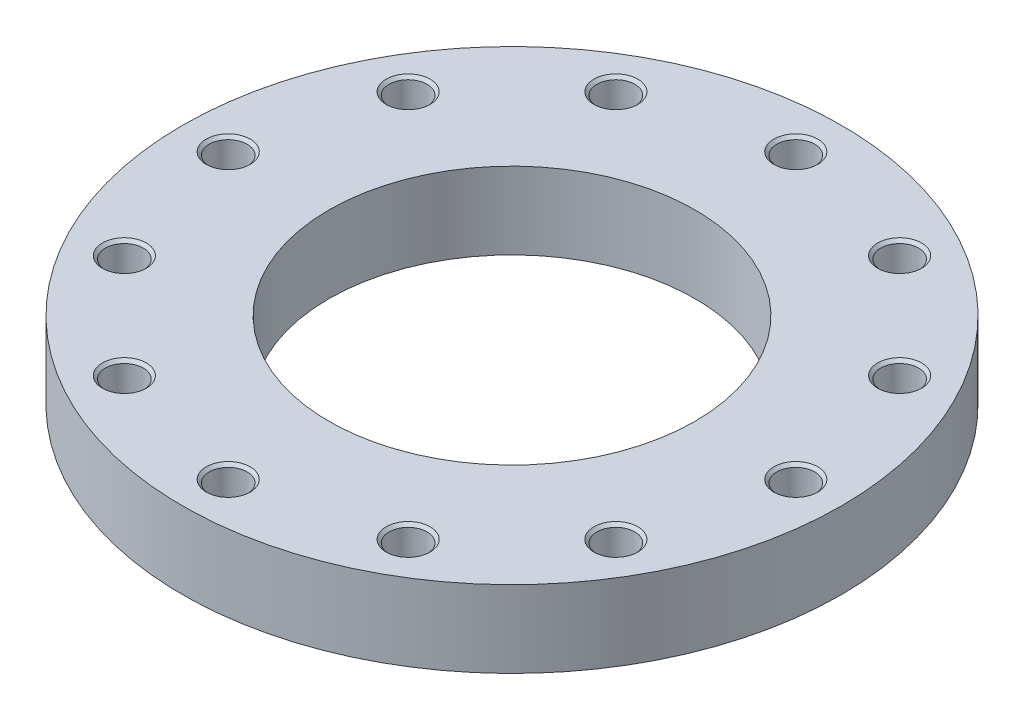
ISO-10303-21;
HEADER;
FILE_DESCRIPTION(('STEP AP214'),'2;1');
FILE_NAME('part.step','',(''),(''),'','','');
FILE_SCHEMA(('AUTOMOTIVE_DESIGN { 1 0 10303 214 1 1 1 1 }'));
ENDSEC;
DATA;
#1=APPLICATION_CONTEXT('core data for automotive mechanical design processes');
#2=APPLICATION_PROTOCOL_DEFINITION('international standard','automotive_design',2000,#1);
#3=PRODUCT_CONTEXT('',#1,'mechanical');
#4=PRODUCT('Part','Part','',(#3));
#5=PRODUCT_RELATED_PRODUCT_CATEGORY('part','',(#4));
#6=PRODUCT_DEFINITION_FORMATION('','',#4);
#7=PRODUCT_DEFINITION_CONTEXT('part definition',#1,'design');
#8=PRODUCT_DEFINITION('design','',#6,#7);
#9=PRODUCT_DEFINITION_SHAPE('','',#8);
#10=(LENGTH_UNIT() NAMED_UNIT(*) SI_UNIT(.MILLI.,.METRE.));
#11=(NAMED_UNIT(*) PLANE_ANGLE_UNIT() SI_UNIT($,.RADIAN.));
#12=(NAMED_UNIT(*) SI_UNIT($,.STERADIAN.) SOLID_ANGLE_UNIT());
#13=UNCERTAINTY_MEASURE_WITH_UNIT(LENGTH_MEASURE(1.E-05),#10,'distance_accuracy_value','');
#14=(GEOMETRIC_REPRESENTATION_CONTEXT(3) GLOBAL_UNCERTAINTY_ASSIGNED_CONTEXT((#13)) GLOBAL_UNIT_ASSIGNED_CONTEXT((#10,
#11,#12)) REPRESENTATION_CONTEXT('',''));
#15=CARTESIAN_POINT('',(0.,0.,0.));
#16=DIRECTION('',(0.,0.,1.));
#17=DIRECTION('',(1.,0.,0.));
#18=AXIS2_PLACEMENT_3D('',#15,#16,#17);
#19=CARTESIAN_POINT('',(0.,21.,0.));
#20=DIRECTION('',(0.,-1.,0.));
#21=DIRECTION('',(1.,0.,0.));
#22=AXIS2_PLACEMENT_3D('',#19,#20,#21);
#23=CYLINDRICAL_SURFACE('',#22,180.);
#24=CARTESIAN_POINT('',(0.,0.,0.));
#25=DIRECTION('',(0.,1.,0.));
#26=DIRECTION('',(1.,0.,0.));
#27=AXIS2_PLACEMENT_3D('',#24,#25,#26);
#28=CIRCLE('',#27,180.);
#29=CARTESIAN_POINT('',(180.,0.,0.));
#30=VERTEX_POINT('',#29);
#31=EDGE_CURVE('E9',#30,#30,#28,.T.);
#32=ORIENTED_EDGE('',*,*,#31,.T.);
#33=EDGE_LOOP('',(#32));
#34=FACE_BOUND('',#33,.T.);
#35=CARTESIAN_POINT('',(0.,42.,0.));
#36=DIRECTION('',(0.,1.,0.));
#37=DIRECTION('',(1.,0.,0.));
#38=AXIS2_PLACEMENT_3D('',#35,#36,#37);
#39=CIRCLE('',#38,180.);
#40=CARTESIAN_POINT('',(180.,42.,0.));
#41=VERTEX_POINT('',#40);
#42=EDGE_CURVE('E326',#41,#41,#39,.T.);
#43=ORIENTED_EDGE('',*,*,#42,.F.);
#44=EDGE_LOOP('',(#43));
#45=FACE_BOUND('',#44,.T.);
#46=ADVANCED_FACE('F15',(#34,#45),#23,.T.);
#47=CARTESIAN_POINT('',(140.,0.,0.));
#48=DIRECTION('',(0.,-1.,0.));
#49=DIRECTION('',(-1.,0.,0.));
#50=AXIS2_PLACEMENT_3D('',#47,#48,#49);
#51=PLANE('',#50);
#52=CARTESIAN_POINT('',(0.,0.,0.));
#53=DIRECTION('',(0.,1.,0.));
#54=DIRECTION('',(1.,0.,0.));
#55=AXIS2_PLACEMENT_3D('',#52,#53,#54);
#56=CIRCLE('',#55,100.);
#57=CARTESIAN_POINT('',(100.,0.,0.));
#58=VERTEX_POINT('',#57);
#59=EDGE_CURVE('E22',#58,#58,#56,.T.);
#60=ORIENTED_EDGE('',*,*,#59,.T.);
#61=EDGE_LOOP('',(#60));
#62=FACE_BOUND('',#61,.T.);
#63=ORIENTED_EDGE('',*,*,#31,.F.);
#64=EDGE_LOOP('',(#63));
#65=FACE_BOUND('',#64,.T.);
#66=ADVANCED_FACE('F426',(#62,#65),#51,.T.);
#67=CARTESIAN_POINT('',(0.,21.,0.));
#68=DIRECTION('',(0.,-1.,0.));
#69=DIRECTION('',(1.,0.,0.));
#70=AXIS2_PLACEMENT_3D('',#67,#68,#69);
#71=CYLINDRICAL_SURFACE('',#70,100.);
#72=CARTESIAN_POINT('',(0.,42.,0.));
#73=DIRECTION('',(0.,1.,0.));
#74=DIRECTION('',(1.,0.,0.));
#75=AXIS2_PLACEMENT_3D('',#72,#73,#74);
#76=CIRCLE('',#75,100.);
#77=CARTESIAN_POINT('',(100.,42.,0.));
#78=VERTEX_POINT('',#77);
#79=EDGE_CURVE('E324',#78,#78,#76,.T.);
#80=ORIENTED_EDGE('',*,*,#79,.T.);
#81=EDGE_LOOP('',(#80));
#82=FACE_BOUND('',#81,.T.);
#83=ORIENTED_EDGE('',*,*,#59,.F.);
#84=EDGE_LOOP('',(#83));
#85=FACE_BOUND('',#84,.T.);
#86=ADVANCED_FACE('F422',(#82,#85),#71,.F.);
#87=CARTESIAN_POINT('',(140.,42.,0.));
#88=DIRECTION('',(0.,1.,0.));
#89=DIRECTION('',(1.,0.,0.));
#90=AXIS2_PLACEMENT_3D('',#87,#88,#89);
#91=PLANE('',#90);
#92=ORIENTED_EDGE('',*,*,#42,.T.);
#93=EDGE_LOOP('',(#92));
#94=FACE_BOUND('',#93,.T.);
#95=ORIENTED_EDGE('',*,*,#79,.F.);
#96=EDGE_LOOP('',(#95));
#97=FACE_BOUND('',#96,.T.);
#98=CARTESIAN_POINT('',(155.,42.,0.));
#99=DIRECTION('',(0.,-1.,0.));
#100=DIRECTION('',(1.,0.,0.));
#101=AXIS2_PLACEMENT_3D('',#98,#99,#100);
#102=CIRCLE('',#101,12.);
#103=CARTESIAN_POINT('',(167.,42.,0.));
#104=VERTEX_POINT('',#103);
#105=EDGE_CURVE('E388',#104,#104,#102,.T.);
#106=ORIENTED_EDGE('',*,*,#105,.T.);
#107=EDGE_LOOP('',(#106));
#108=FACE_BOUND('',#107,.T.);
#109=CARTESIAN_POINT('',(134.233937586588,42.,-77.5));
#110=DIRECTION('',(0.,-1.,0.));
#111=DIRECTION('',(0.866025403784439,0.,-0.5));
#112=AXIS2_PLACEMENT_3D('',#109,#110,#111);
#113=CIRCLE('',#112,12.);
#114=CARTESIAN_POINT('',(144.626242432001,42.,-83.5));
#115=VERTEX_POINT('',#114);
#116=EDGE_CURVE('E329',#115,#115,#113,.T.);
#117=ORIENTED_EDGE('',*,*,#116,.T.);
#118=EDGE_LOOP('',(#117));
#119=FACE_BOUND('',#118,.T.);
#120=CARTESIAN_POINT('',(77.5,42.,-134.233937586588));
#121=DIRECTION('',(0.,-1.,0.));
#122=DIRECTION('',(0.5,0.,-0.866025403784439));
#123=AXIS2_PLACEMENT_3D('',#120,#121,#122);
#124=CIRCLE('',#123,12.);
#125=CARTESIAN_POINT('',(83.5,42.,-144.626242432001));
#126=VERTEX_POINT('',#125);
#127=EDGE_CURVE('E385',#126,#126,#124,.T.);
#128=ORIENTED_EDGE('',*,*,#127,.T.);
#129=EDGE_LOOP('',(#128));
#130=FACE_BOUND('',#129,.T.);
#131=CARTESIAN_POINT('',(0.,42.,-155.));
#132=DIRECTION('',(0.,-1.,0.));
#133=DIRECTION('',(0.,0.,-1.));
#134=AXIS2_PLACEMENT_3D('',#131,#132,#133);
#135=CIRCLE('',#134,12.);
#136=CARTESIAN_POINT('',(0.,42.,-167.));
#137=VERTEX_POINT('',#136);
#138=EDGE_CURVE('E374',#137,#137,#135,.T.);
#139=ORIENTED_EDGE('',*,*,#138,.T.);
#140=EDGE_LOOP('',(#139));
#141=FACE_BOUND('',#140,.T.);
#142=CARTESIAN_POINT('',(-77.5,42.,-134.233937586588));
#143=DIRECTION('',(0.,-1.,0.));
#144=DIRECTION('',(-0.5,0.,-0.866025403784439));
#145=AXIS2_PLACEMENT_3D('',#142,#143,#144);
#146=CIRCLE('',#145,12.);
#147=CARTESIAN_POINT('',(-83.5,42.,-144.626242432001));
#148=VERTEX_POINT('',#147);
#149=EDGE_CURVE('E363',#148,#148,#146,.T.);
#150=ORIENTED_EDGE('',*,*,#149,.T.);
#151=EDGE_LOOP('',(#150));
#152=FACE_BOUND('',#151,.T.);
#153=CARTESIAN_POINT('',(-134.233937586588,42.,-77.5));
#154=DIRECTION('',(0.,-1.,0.));
#155=DIRECTION('',(-0.866025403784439,0.,-0.5));
#156=AXIS2_PLACEMENT_3D('',#153,#154,#155);
#157=CIRCLE('',#156,12.);
#158=CARTESIAN_POINT('',(-144.626242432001,42.,-83.5));
#159=VERTEX_POINT('',#158);
#160=EDGE_CURVE('E315',#159,#159,#157,.T.);
#161=ORIENTED_EDGE('',*,*,#160,.T.);
#162=EDGE_LOOP('',(#161));
#163=FACE_BOUND('',#162,.T.);
#164=CARTESIAN_POINT('',(-155.,42.,0.));
#165=DIRECTION('',(0.,-1.,0.));
#166=DIRECTION('',(-1.,0.,0.));
#167=AXIS2_PLACEMENT_3D('',#164,#165,#166);
#168=CIRCLE('',#167,12.);
#169=CARTESIAN_POINT('',(-167.,42.,0.));
#170=VERTEX_POINT('',#169);
#171=EDGE_CURVE('E337',#170,#170,#168,.T.);
#172=ORIENTED_EDGE('',*,*,#171,.T.);
#173=EDGE_LOOP('',(#172));
#174=FACE_BOUND('',#173,.T.);
#175=CARTESIAN_POINT('',(-134.233937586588,42.,77.5));
#176=DIRECTION('',(0.,-1.,0.));
#177=DIRECTION('',(-0.866025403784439,0.,0.5));
#178=AXIS2_PLACEMENT_3D('',#175,#176,#177);
#179=CIRCLE('',#178,12.);
#180=CARTESIAN_POINT('',(-144.626242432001,42.,83.5));
#181=VERTEX_POINT('',#180);
#182=EDGE_CURVE('E293',#181,#181,#179,.T.);
#183=ORIENTED_EDGE('',*,*,#182,.T.);
#184=EDGE_LOOP('',(#183));
#185=FACE_BOUND('',#184,.T.);
#186=CARTESIAN_POINT('',(-77.5,42.,134.233937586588));
#187=DIRECTION('',(0.,-1.,0.));
#188=DIRECTION('',(-0.5,0.,0.866025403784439));
#189=AXIS2_PLACEMENT_3D('',#186,#187,#188);
#190=CIRCLE('',#189,12.);
#191=CARTESIAN_POINT('',(-83.5,42.,144.626242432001));
#192=VERTEX_POINT('',#191);
#193=EDGE_CURVE('E311',#192,#192,#190,.T.);
#194=ORIENTED_EDGE('',*,*,#193,.T.);
#195=EDGE_LOOP('',(#194));
#196=FACE_BOUND('',#195,.T.);
#197=CARTESIAN_POINT('',(0.,42.,155.));
#198=DIRECTION('',(0.,-1.,0.));
#199=DIRECTION('',(0.,0.,1.));
#200=AXIS2_PLACEMENT_3D('',#197,#198,#199);
#201=CIRCLE('',#200,12.);
#202=CARTESIAN_POINT('',(0.,42.,167.));
#203=VERTEX_POINT('',#202);
#204=EDGE_CURVE('E455',#203,#203,#201,.T.);
#205=ORIENTED_EDGE('',*,*,#204,.T.);
#206=EDGE_LOOP('',(#205));
#207=FACE_BOUND('',#206,.T.);
#208=CARTESIAN_POINT('',(77.5,42.,134.233937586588));
#209=DIRECTION('',(0.,-1.,0.));
#210=DIRECTION('',(0.5,0.,0.866025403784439));
#211=AXIS2_PLACEMENT_3D('',#208,#209,#210);
#212=CIRCLE('',#211,12.);
#213=CARTESIAN_POINT('',(83.5,42.,144.626242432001));
#214=VERTEX_POINT('',#213);
#215=EDGE_CURVE('E458',#214,#214,#212,.T.);
#216=ORIENTED_EDGE('',*,*,#215,.T.);
#217=EDGE_LOOP('',(#216));
#218=FACE_BOUND('',#217,.T.);
#219=CARTESIAN_POINT('',(134.233937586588,42.,77.5));
#220=DIRECTION('',(0.,-1.,0.));
#221=DIRECTION('',(0.866025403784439,0.,0.5));
#222=AXIS2_PLACEMENT_3D('',#219,#220,#221);
#223=CIRCLE('',#222,12.);
#224=CARTESIAN_POINT('',(144.626242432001,42.,83.5));
#225=VERTEX_POINT('',#224);
#226=EDGE_CURVE('E460',#225,#225,#223,.T.);
#227=ORIENTED_EDGE('',*,*,#226,.T.);
#228=EDGE_LOOP('',(#227));
#229=FACE_BOUND('',#228,.T.);
#230=ADVANCED_FACE('F412',(#94,#97,#108,#119,#130,#141,#152,#163,#174,#185,#196,#207,#218,#229),
#91,.T.);
#231=CARTESIAN_POINT('',(155.,6.00463463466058,0.));
#232=DIRECTION('',(0.,1.,0.));
#233=DIRECTION('',(1.,0.,0.));
#234=AXIS2_PLACEMENT_3D('',#231,#232,#233);
#235=CONICAL_SURFACE('',#234,5.188125,1.0471975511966);
#236=CARTESIAN_POINT('',(155.,9.,0.));
#237=DIRECTION('',(0.,-1.,0.));
#238=DIRECTION('',(1.,0.,0.));
#239=AXIS2_PLACEMENT_3D('',#236,#237,#238);
#240=CIRCLE('',#239,10.37625);
#241=CARTESIAN_POINT('',(165.37625,9.,0.));
#242=VERTEX_POINT('',#241);
#243=EDGE_CURVE('E327',#242,#242,#240,.T.);
#244=ORIENTED_EDGE('',*,*,#243,.F.);
#245=EDGE_LOOP('',(#244));
#246=FACE_BOUND('',#245,.T.);
#247=CARTESIAN_POINT('',(155.,3.00926926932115,0.));
#248=VERTEX_POINT('',#247);
#249=VERTEX_LOOP('',#248);
#250=FACE_BOUND('',#249,.T.);
#251=ADVANCED_FACE('F409',(#246,#250),#235,.F.);
#252=CARTESIAN_POINT('',(155.,12.688125,0.));
#253=DIRECTION('',(0.,1.,0.));
#254=DIRECTION('',(1.,0.,0.));
#255=AXIS2_PLACEMENT_3D('',#252,#253,#254);
#256=CYLINDRICAL_SURFACE('',#255,10.37625);
#257=CARTESIAN_POINT('',(155.,16.37625,0.));
#258=DIRECTION('',(0.,-1.,0.));
#259=DIRECTION('',(1.,0.,0.));
#260=AXIS2_PLACEMENT_3D('',#257,#258,#259);
#261=CIRCLE('',#260,10.37625);
#262=CARTESIAN_POINT('',(165.37625,16.37625,0.));
#263=VERTEX_POINT('',#262);
#264=EDGE_CURVE('E345',#263,#263,#261,.T.);
#265=ORIENTED_EDGE('',*,*,#264,.F.);
#266=EDGE_LOOP('',(#265));
#267=FACE_BOUND('',#266,.T.);
#268=ORIENTED_EDGE('',*,*,#243,.T.);
#269=EDGE_LOOP('',(#268));
#270=FACE_BOUND('',#269,.T.);
#271=ADVANCED_FACE('F407',(#267,#270),#256,.F.);
#272=CARTESIAN_POINT('',(155.,17.188125,0.));
#273=DIRECTION('',(0.,1.,0.));
#274=DIRECTION('',(1.,0.,0.));
#275=AXIS2_PLACEMENT_3D('',#272,#273,#274);
#276=CONICAL_SURFACE('',#275,11.188125,0.785398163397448);
#277=CARTESIAN_POINT('',(155.,18.,0.));
#278=DIRECTION('',(0.,-1.,0.));
#279=DIRECTION('',(1.,0.,0.));
#280=AXIS2_PLACEMENT_3D('',#277,#278,#279);
#281=CIRCLE('',#280,12.);
#282=CARTESIAN_POINT('',(167.,18.,0.));
#283=VERTEX_POINT('',#282);
#284=EDGE_CURVE('E347',#283,#283,#281,.T.);
#285=ORIENTED_EDGE('',*,*,#284,.F.);
#286=EDGE_LOOP('',(#285));
#287=FACE_BOUND('',#286,.T.);
#288=ORIENTED_EDGE('',*,*,#264,.T.);
#289=EDGE_LOOP('',(#288));
#290=FACE_BOUND('',#289,.T.);
#291=ADVANCED_FACE('F419',(#287,#290),#276,.F.);
#292=CARTESIAN_POINT('',(166.188125,18.,0.));
#293=DIRECTION('',(0.,1.,0.));
#294=DIRECTION('',(-1.,0.,0.));
#295=AXIS2_PLACEMENT_3D('',#292,#293,#294);
#296=PLANE('',#295);
#297=CARTESIAN_POINT('',(155.,18.,0.));
#298=DIRECTION('',(0.,-1.,0.));
#299=DIRECTION('',(1.,0.,0.));
#300=AXIS2_PLACEMENT_3D('',#297,#298,#299);
#301=CIRCLE('',#300,10.37625);
#302=CARTESIAN_POINT('',(165.37625,18.,0.));
#303=VERTEX_POINT('',#302);
#304=EDGE_CURVE('E403',#303,#303,#301,.T.);
#305=ORIENTED_EDGE('',*,*,#304,.F.);
#306=EDGE_LOOP('',(#305));
#307=FACE_BOUND('',#306,.T.);
#308=ORIENTED_EDGE('',*,*,#284,.T.);
#309=EDGE_LOOP('',(#308));
#310=FACE_BOUND('',#309,.T.);
#311=ADVANCED_FACE('F630',(#307,#310),#296,.F.);
#312=CARTESIAN_POINT('',(155.,29.188125,0.));
#313=DIRECTION('',(0.,1.,0.));
#314=DIRECTION('',(1.,0.,0.));
#315=AXIS2_PLACEMENT_3D('',#312,#313,#314);
#316=CYLINDRICAL_SURFACE('',#315,10.37625);
#317=CARTESIAN_POINT('',(155.,40.37625,0.));
#318=DIRECTION('',(0.,-1.,0.));
#319=DIRECTION('',(1.,0.,0.));
#320=AXIS2_PLACEMENT_3D('',#317,#318,#319);
#321=CIRCLE('',#320,10.37625);
#322=CARTESIAN_POINT('',(165.37625,40.37625,0.));
#323=VERTEX_POINT('',#322);
#324=EDGE_CURVE('E386',#323,#323,#321,.T.);
#325=ORIENTED_EDGE('',*,*,#324,.F.);
#326=EDGE_LOOP('',(#325));
#327=FACE_BOUND('',#326,.T.);
#328=ORIENTED_EDGE('',*,*,#304,.T.);
#329=EDGE_LOOP('',(#328));
#330=FACE_BOUND('',#329,.T.);
#331=ADVANCED_FACE('F626',(#327,#330),#316,.F.);
#332=CARTESIAN_POINT('',(155.,41.188125,0.));
#333=DIRECTION('',(0.,1.,0.));
#334=DIRECTION('',(1.,0.,0.));
#335=AXIS2_PLACEMENT_3D('',#332,#333,#334);
#336=CONICAL_SURFACE('',#335,11.188125,0.785398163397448);
#337=ORIENTED_EDGE('',*,*,#105,.F.);
#338=EDGE_LOOP('',(#337));
#339=FACE_BOUND('',#338,.T.);
#340=ORIENTED_EDGE('',*,*,#324,.T.);
#341=EDGE_LOOP('',(#340));
#342=FACE_BOUND('',#341,.T.);
#343=ADVANCED_FACE('F629',(#339,#342),#336,.F.);
#344=CARTESIAN_POINT('',(134.233937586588,6.00463463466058,-77.5));
#345=DIRECTION('',(0.,1.,0.));
#346=DIRECTION('',(0.866025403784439,0.,-0.5));
#347=AXIS2_PLACEMENT_3D('',#344,#345,#346);
#348=CONICAL_SURFACE('',#347,5.188125,1.0471975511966);
#349=CARTESIAN_POINT('',(134.233937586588,9.,-77.5));
#350=DIRECTION('',(0.,-1.,0.));
#351=DIRECTION('',(0.866025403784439,0.,-0.5));
#352=AXIS2_PLACEMENT_3D('',#349,#350,#351);
#353=CIRCLE('',#352,10.37625);
#354=CARTESIAN_POINT('',(143.220033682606,9.,-82.688125));
#355=VERTEX_POINT('',#354);
#356=EDGE_CURVE('E389',#355,#355,#353,.T.);
#357=ORIENTED_EDGE('',*,*,#356,.F.);
#358=EDGE_LOOP('',(#357));
#359=FACE_BOUND('',#358,.T.);
#360=CARTESIAN_POINT('',(134.233937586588,3.00926926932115,-77.5));
#361=VERTEX_POINT('',#360);
#362=VERTEX_LOOP('',#361);
#363=FACE_BOUND('',#362,.T.);
#364=ADVANCED_FACE('F721',(#359,#363),#348,.F.);
#365=CARTESIAN_POINT('',(134.233937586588,12.688125,-77.5));
#366=DIRECTION('',(0.,1.,0.));
#367=DIRECTION('',(0.866025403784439,0.,-0.5));
#368=AXIS2_PLACEMENT_3D('',#365,#366,#367);
#369=CYLINDRICAL_SURFACE('',#368,10.37625);
#370=CARTESIAN_POINT('',(134.233937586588,16.37625,-77.5));
#371=DIRECTION('',(0.,-1.,0.));
#372=DIRECTION('',(0.866025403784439,0.,-0.5));
#373=AXIS2_PLACEMENT_3D('',#370,#371,#372);
#374=CIRCLE('',#373,10.37625);
#375=CARTESIAN_POINT('',(143.220033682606,16.37625,-82.688125));
#376=VERTEX_POINT('',#375);
#377=EDGE_CURVE('E400',#376,#376,#374,.T.);
#378=ORIENTED_EDGE('',*,*,#377,.F.);
#379=EDGE_LOOP('',(#378));
#380=FACE_BOUND('',#379,.T.);
#381=ORIENTED_EDGE('',*,*,#356,.T.);
#382=EDGE_LOOP('',(#381));
#383=FACE_BOUND('',#382,.T.);
#384=ADVANCED_FACE('F745',(#380,#383),#369,.F.);
#385=CARTESIAN_POINT('',(134.233937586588,17.188125,-77.5));
#386=DIRECTION('',(0.,1.,0.));
#387=DIRECTION('',(0.866025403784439,0.,-0.5));
#388=AXIS2_PLACEMENT_3D('',#385,#386,#387);
#389=CONICAL_SURFACE('',#388,11.188125,0.785398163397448);
#390=CARTESIAN_POINT('',(134.233937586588,18.,-77.5));
#391=DIRECTION('',(0.,-1.,0.));
#392=DIRECTION('',(0.866025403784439,0.,-0.5));
#393=AXIS2_PLACEMENT_3D('',#390,#391,#392);
#394=CIRCLE('',#393,12.);
#395=CARTESIAN_POINT('',(144.626242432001,18.,-83.5));
#396=VERTEX_POINT('',#395);
#397=EDGE_CURVE('E398',#396,#396,#394,.T.);
#398=ORIENTED_EDGE('',*,*,#397,.F.);
#399=EDGE_LOOP('',(#398));
#400=FACE_BOUND('',#399,.T.);
#401=ORIENTED_EDGE('',*,*,#377,.T.);
#402=EDGE_LOOP('',(#401));
#403=FACE_BOUND('',#402,.T.);
#404=ADVANCED_FACE('F741',(#400,#403),#389,.F.);
#405=CARTESIAN_POINT('',(143.923138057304,18.,-83.0940625));
#406=DIRECTION('',(0.,1.,0.));
#407=DIRECTION('',(-0.866025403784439,0.,0.5));
#408=AXIS2_PLACEMENT_3D('',#405,#406,#407);
#409=PLANE('',#408);
#410=CARTESIAN_POINT('',(134.233937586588,18.,-77.5));
#411=DIRECTION('',(0.,-1.,0.));
#412=DIRECTION('',(0.866025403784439,0.,-0.5));
#413=AXIS2_PLACEMENT_3D('',#410,#411,#412);
#414=CIRCLE('',#413,10.37625);
#415=CARTESIAN_POINT('',(143.220033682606,18.,-82.688125));
#416=VERTEX_POINT('',#415);
#417=EDGE_CURVE('E330',#416,#416,#414,.T.);
#418=ORIENTED_EDGE('',*,*,#417,.F.);
#419=EDGE_LOOP('',(#418));
#420=FACE_BOUND('',#419,.T.);
#421=ORIENTED_EDGE('',*,*,#397,.T.);
#422=EDGE_LOOP('',(#421));
#423=FACE_BOUND('',#422,.T.);
#424=ADVANCED_FACE('F570',(#420,#423),#409,.F.);
#425=CARTESIAN_POINT('',(134.233937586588,29.188125,-77.5));
#426=DIRECTION('',(0.,1.,0.));
#427=DIRECTION('',(0.866025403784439,0.,-0.5));
#428=AXIS2_PLACEMENT_3D('',#425,#426,#427);
#429=CYLINDRICAL_SURFACE('',#428,10.37625);
#430=CARTESIAN_POINT('',(134.233937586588,40.37625,-77.5));
#431=DIRECTION('',(0.,-1.,0.));
#432=DIRECTION('',(0.866025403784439,0.,-0.5));
#433=AXIS2_PLACEMENT_3D('',#430,#431,#432);
#434=CIRCLE('',#433,10.37625);
#435=CARTESIAN_POINT('',(143.220033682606,40.37625,-82.688125));
#436=VERTEX_POINT('',#435);
#437=EDGE_CURVE('E331',#436,#436,#434,.T.);
#438=ORIENTED_EDGE('',*,*,#437,.F.);
#439=EDGE_LOOP('',(#438));
#440=FACE_BOUND('',#439,.T.);
#441=ORIENTED_EDGE('',*,*,#417,.T.);
#442=EDGE_LOOP('',(#441));
#443=FACE_BOUND('',#442,.T.);
#444=ADVANCED_FACE('F566',(#440,#443),#429,.F.);
#445=CARTESIAN_POINT('',(134.233937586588,41.188125,-77.5));
#446=DIRECTION('',(0.,1.,0.));
#447=DIRECTION('',(0.866025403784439,0.,-0.5));
#448=AXIS2_PLACEMENT_3D('',#445,#446,#447);
#449=CONICAL_SURFACE('',#448,11.188125,0.785398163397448);
#450=ORIENTED_EDGE('',*,*,#116,.F.);
#451=EDGE_LOOP('',(#450));
#452=FACE_BOUND('',#451,.T.);
#453=ORIENTED_EDGE('',*,*,#437,.T.);
#454=EDGE_LOOP('',(#453));
#455=FACE_BOUND('',#454,.T.);
#456=ADVANCED_FACE('F569',(#452,#455),#449,.F.);
#457=CARTESIAN_POINT('',(77.5,6.00463463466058,-134.233937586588));
#458=DIRECTION('',(0.,1.,0.));
#459=DIRECTION('',(0.5,0.,-0.866025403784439));
#460=AXIS2_PLACEMENT_3D('',#457,#458,#459);
#461=CONICAL_SURFACE('',#460,5.188125,1.0471975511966);
#462=CARTESIAN_POINT('',(77.5,9.,-134.233937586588));
#463=DIRECTION('',(0.,-1.,0.));
#464=DIRECTION('',(0.5,0.,-0.866025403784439));
#465=AXIS2_PLACEMENT_3D('',#462,#463,#464);
#466=CIRCLE('',#465,10.37625);
#467=CARTESIAN_POINT('',(82.688125,9.,-143.220033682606));
#468=VERTEX_POINT('',#467);
#469=EDGE_CURVE('E360',#468,#468,#466,.T.);
#470=ORIENTED_EDGE('',*,*,#469,.F.);
#471=EDGE_LOOP('',(#470));
#472=FACE_BOUND('',#471,.T.);
#473=CARTESIAN_POINT('',(77.5,3.00926926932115,-134.233937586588));
#474=VERTEX_POINT('',#473);
#475=VERTEX_LOOP('',#474);
#476=FACE_BOUND('',#475,.T.);
#477=ADVANCED_FACE('F734',(#472,#476),#461,.F.);
#478=CARTESIAN_POINT('',(77.5,12.688125,-134.233937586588));
#479=DIRECTION('',(0.,1.,0.));
#480=DIRECTION('',(0.5,0.,-0.866025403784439));
#481=AXIS2_PLACEMENT_3D('',#478,#479,#480);
#482=CYLINDRICAL_SURFACE('',#481,10.37625);
#483=CARTESIAN_POINT('',(77.5,16.37625,-134.233937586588));
#484=DIRECTION('',(0.,-1.,0.));
#485=DIRECTION('',(0.5,0.,-0.866025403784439));
#486=AXIS2_PLACEMENT_3D('',#483,#484,#485);
#487=CIRCLE('',#486,10.37625);
#488=CARTESIAN_POINT('',(82.688125,16.37625,-143.220033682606));
#489=VERTEX_POINT('',#488);
#490=EDGE_CURVE('E358',#489,#489,#487,.T.);
#491=ORIENTED_EDGE('',*,*,#490,.F.);
#492=EDGE_LOOP('',(#491));
#493=FACE_BOUND('',#492,.T.);
#494=ORIENTED_EDGE('',*,*,#469,.T.);
#495=EDGE_LOOP('',(#494));
#496=FACE_BOUND('',#495,.T.);
#497=ADVANCED_FACE('F730',(#493,#496),#482,.F.);
#498=CARTESIAN_POINT('',(77.5,17.188125,-134.233937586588));
#499=DIRECTION('',(0.,1.,0.));
#500=DIRECTION('',(0.5,0.,-0.866025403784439));
#501=AXIS2_PLACEMENT_3D('',#498,#499,#500);
#502=CONICAL_SURFACE('',#501,11.188125,0.785398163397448);
#503=CARTESIAN_POINT('',(77.5,18.,-134.233937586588));
#504=DIRECTION('',(0.,-1.,0.));
#505=DIRECTION('',(0.5,0.,-0.866025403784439));
#506=AXIS2_PLACEMENT_3D('',#503,#504,#505);
#507=CIRCLE('',#506,12.);
#508=CARTESIAN_POINT('',(83.5,18.,-144.626242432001));
#509=VERTEX_POINT('',#508);
#510=EDGE_CURVE('E361',#509,#509,#507,.T.);
#511=ORIENTED_EDGE('',*,*,#510,.F.);
#512=EDGE_LOOP('',(#511));
#513=FACE_BOUND('',#512,.T.);
#514=ORIENTED_EDGE('',*,*,#490,.T.);
#515=EDGE_LOOP('',(#514));
#516=FACE_BOUND('',#515,.T.);
#517=ADVANCED_FACE('F727',(#513,#516),#502,.F.);
#518=CARTESIAN_POINT('',(83.0940625,18.,-143.923138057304));
#519=DIRECTION('',(0.,1.,0.));
#520=DIRECTION('',(-0.5,0.,0.866025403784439));
#521=AXIS2_PLACEMENT_3D('',#518,#519,#520);
#522=PLANE('',#521);
#523=CARTESIAN_POINT('',(77.5,18.,-134.233937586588));
#524=DIRECTION('',(0.,-1.,0.));
#525=DIRECTION('',(0.5,0.,-0.866025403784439));
#526=AXIS2_PLACEMENT_3D('',#523,#524,#525);
#527=CIRCLE('',#526,10.37625);
#528=CARTESIAN_POINT('',(82.688125,18.,-143.220033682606));
#529=VERTEX_POINT('',#528);
#530=EDGE_CURVE('E391',#529,#529,#527,.T.);
#531=ORIENTED_EDGE('',*,*,#530,.F.);
#532=EDGE_LOOP('',(#531));
#533=FACE_BOUND('',#532,.T.);
#534=ORIENTED_EDGE('',*,*,#510,.T.);
#535=EDGE_LOOP('',(#534));
#536=FACE_BOUND('',#535,.T.);
#537=ADVANCED_FACE('F725',(#533,#536),#522,.F.);
#538=CARTESIAN_POINT('',(77.5,29.188125,-134.233937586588));
#539=DIRECTION('',(0.,1.,0.));
#540=DIRECTION('',(0.5,0.,-0.866025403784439));
#541=AXIS2_PLACEMENT_3D('',#538,#539,#540);
#542=CYLINDRICAL_SURFACE('',#541,10.37625);
#543=CARTESIAN_POINT('',(77.5,40.37625,-134.233937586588));
#544=DIRECTION('',(0.,-1.,0.));
#545=DIRECTION('',(0.5,0.,-0.866025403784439));
#546=AXIS2_PLACEMENT_3D('',#543,#544,#545);
#547=CIRCLE('',#546,10.37625);
#548=CARTESIAN_POINT('',(82.688125,40.37625,-143.220033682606));
#549=VERTEX_POINT('',#548);
#550=EDGE_CURVE('E383',#549,#549,#547,.T.);
#551=ORIENTED_EDGE('',*,*,#550,.F.);
#552=EDGE_LOOP('',(#551));
#553=FACE_BOUND('',#552,.T.);
#554=ORIENTED_EDGE('',*,*,#530,.T.);
#555=EDGE_LOOP('',(#554));
#556=FACE_BOUND('',#555,.T.);
#557=ADVANCED_FACE('F520',(#553,#556),#542,.F.);
#558=CARTESIAN_POINT('',(77.5,41.188125,-134.233937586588));
#559=DIRECTION('',(0.,1.,0.));
#560=DIRECTION('',(0.5,0.,-0.866025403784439));
#561=AXIS2_PLACEMENT_3D('',#558,#559,#560);
#562=CONICAL_SURFACE('',#561,11.188125,0.785398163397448);
#563=ORIENTED_EDGE('',*,*,#127,.F.);
#564=EDGE_LOOP('',(#563));
#565=FACE_BOUND('',#564,.T.);
#566=ORIENTED_EDGE('',*,*,#550,.T.);
#567=EDGE_LOOP('',(#566));
#568=FACE_BOUND('',#567,.T.);
#569=ADVANCED_FACE('F516',(#565,#568),#562,.F.);
#570=CARTESIAN_POINT('',(0.,6.00463463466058,-155.));
#571=DIRECTION('',(0.,1.,0.));
#572=DIRECTION('',(0.,0.,-1.));
#573=AXIS2_PLACEMENT_3D('',#570,#571,#572);
#574=CONICAL_SURFACE('',#573,5.188125,1.0471975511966);
#575=CARTESIAN_POINT('',(0.,9.,-155.));
#576=DIRECTION('',(0.,-1.,0.));
#577=DIRECTION('',(0.,0.,-1.));
#578=AXIS2_PLACEMENT_3D('',#575,#576,#577);
#579=CIRCLE('',#578,10.37625);
#580=CARTESIAN_POINT('',(0.,9.,-165.37625));
#581=VERTEX_POINT('',#580);
#582=EDGE_CURVE('E381',#581,#581,#579,.T.);
#583=ORIENTED_EDGE('',*,*,#582,.F.);
#584=EDGE_LOOP('',(#583));
#585=FACE_BOUND('',#584,.T.);
#586=CARTESIAN_POINT('',(0.,3.00926926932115,-155.));
#587=VERTEX_POINT('',#586);
#588=VERTEX_LOOP('',#587);
#589=FACE_BOUND('',#588,.T.);
#590=ADVANCED_FACE('F519',(#585,#589),#574,.F.);
#591=CARTESIAN_POINT('',(0.,12.688125,-155.));
#592=DIRECTION('',(0.,1.,0.));
#593=DIRECTION('',(0.,0.,-1.));
#594=AXIS2_PLACEMENT_3D('',#591,#592,#593);
#595=CYLINDRICAL_SURFACE('',#594,10.37625);
#596=CARTESIAN_POINT('',(0.,16.37625,-155.));
#597=DIRECTION('',(0.,-1.,0.));
#598=DIRECTION('',(0.,0.,-1.));
#599=AXIS2_PLACEMENT_3D('',#596,#597,#598);
#600=CIRCLE('',#599,10.37625);
#601=CARTESIAN_POINT('',(0.,16.37625,-165.37625));
#602=VERTEX_POINT('',#601);
#603=EDGE_CURVE('E379',#602,#602,#600,.T.);
#604=ORIENTED_EDGE('',*,*,#603,.F.);
#605=EDGE_LOOP('',(#604));
#606=FACE_BOUND('',#605,.T.);
#607=ORIENTED_EDGE('',*,*,#582,.T.);
#608=EDGE_LOOP('',(#607));
#609=FACE_BOUND('',#608,.T.);
#610=ADVANCED_FACE('F711',(#606,#609),#595,.F.);
#611=CARTESIAN_POINT('',(0.,17.188125,-155.));
#612=DIRECTION('',(0.,1.,0.));
#613=DIRECTION('',(0.,0.,-1.));
#614=AXIS2_PLACEMENT_3D('',#611,#612,#613);
#615=CONICAL_SURFACE('',#614,11.188125,0.785398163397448);
#616=CARTESIAN_POINT('',(0.,18.,-155.));
#617=DIRECTION('',(0.,-1.,0.));
#618=DIRECTION('',(0.,0.,-1.));
#619=AXIS2_PLACEMENT_3D('',#616,#617,#618);
#620=CIRCLE('',#619,12.);
#621=CARTESIAN_POINT('',(0.,18.,-167.));
#622=VERTEX_POINT('',#621);
#623=EDGE_CURVE('E377',#622,#622,#620,.T.);
#624=ORIENTED_EDGE('',*,*,#623,.F.);
#625=EDGE_LOOP('',(#624));
#626=FACE_BOUND('',#625,.T.);
#627=ORIENTED_EDGE('',*,*,#603,.T.);
#628=EDGE_LOOP('',(#627));
#629=FACE_BOUND('',#628,.T.);
#630=ADVANCED_FACE('F707',(#626,#629),#615,.F.);
#631=CARTESIAN_POINT('',(0.,18.,-166.188125));
#632=DIRECTION('',(0.,1.,0.));
#633=DIRECTION('',(0.,0.,1.));
#634=AXIS2_PLACEMENT_3D('',#631,#632,#633);
#635=PLANE('',#634);
#636=CARTESIAN_POINT('',(0.,18.,-155.));
#637=DIRECTION('',(0.,-1.,0.));
#638=DIRECTION('',(0.,0.,-1.));
#639=AXIS2_PLACEMENT_3D('',#636,#637,#638);
#640=CIRCLE('',#639,10.37625);
#641=CARTESIAN_POINT('',(0.,18.,-165.37625));
#642=VERTEX_POINT('',#641);
#643=EDGE_CURVE('E375',#642,#642,#640,.T.);
#644=ORIENTED_EDGE('',*,*,#643,.F.);
#645=EDGE_LOOP('',(#644));
#646=FACE_BOUND('',#645,.T.);
#647=ORIENTED_EDGE('',*,*,#623,.T.);
#648=EDGE_LOOP('',(#647));
#649=FACE_BOUND('',#648,.T.);
#650=ADVANCED_FACE('F703',(#646,#649),#635,.F.);
#651=CARTESIAN_POINT('',(0.,29.188125,-155.));
#652=DIRECTION('',(0.,1.,0.));
#653=DIRECTION('',(0.,0.,-1.));
#654=AXIS2_PLACEMENT_3D('',#651,#652,#653);
#655=CYLINDRICAL_SURFACE('',#654,10.37625);
#656=CARTESIAN_POINT('',(0.,40.37625,-155.));
#657=DIRECTION('',(0.,-1.,0.));
#658=DIRECTION('',(0.,0.,-1.));
#659=AXIS2_PLACEMENT_3D('',#656,#657,#658);
#660=CIRCLE('',#659,10.37625);
#661=CARTESIAN_POINT('',(0.,40.37625,-165.37625));
#662=VERTEX_POINT('',#661);
#663=EDGE_CURVE('E372',#662,#662,#660,.T.);
#664=ORIENTED_EDGE('',*,*,#663,.F.);
#665=EDGE_LOOP('',(#664));
#666=FACE_BOUND('',#665,.T.);
#667=ORIENTED_EDGE('',*,*,#643,.T.);
#668=EDGE_LOOP('',(#667));
#669=FACE_BOUND('',#668,.T.);
#670=ADVANCED_FACE('F699',(#666,#669),#655,.F.);
#671=CARTESIAN_POINT('',(0.,41.188125,-155.));
#672=DIRECTION('',(0.,1.,0.));
#673=DIRECTION('',(0.,0.,-1.));
#674=AXIS2_PLACEMENT_3D('',#671,#672,#673);
#675=CONICAL_SURFACE('',#674,11.188125,0.785398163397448);
#676=ORIENTED_EDGE('',*,*,#138,.F.);
#677=EDGE_LOOP('',(#676));
#678=FACE_BOUND('',#677,.T.);
#679=ORIENTED_EDGE('',*,*,#663,.T.);
#680=EDGE_LOOP('',(#679));
#681=FACE_BOUND('',#680,.T.);
#682=ADVANCED_FACE('F695',(#678,#681),#675,.F.);
#683=CARTESIAN_POINT('',(-77.5,6.00463463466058,-134.233937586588));
#684=DIRECTION('',(0.,1.,0.));
#685=DIRECTION('',(-0.5,0.,-0.866025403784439));
#686=AXIS2_PLACEMENT_3D('',#683,#684,#685);
#687=CONICAL_SURFACE('',#686,5.188125,1.0471975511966);
#688=CARTESIAN_POINT('',(-77.5,9.,-134.233937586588));
#689=DIRECTION('',(0.,-1.,0.));
#690=DIRECTION('',(-0.5,0.,-0.866025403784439));
#691=AXIS2_PLACEMENT_3D('',#688,#689,#690);
#692=CIRCLE('',#691,10.37625);
#693=CARTESIAN_POINT('',(-82.688125,9.,-143.220033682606));
#694=VERTEX_POINT('',#693);
#695=EDGE_CURVE('E370',#694,#694,#692,.T.);
#696=ORIENTED_EDGE('',*,*,#695,.F.);
#697=EDGE_LOOP('',(#696));
#698=FACE_BOUND('',#697,.T.);
#699=CARTESIAN_POINT('',(-77.5,3.00926926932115,-134.233937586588));
#700=VERTEX_POINT('',#699);
#701=VERTEX_LOOP('',#700);
#702=FACE_BOUND('',#701,.T.);
#703=ADVANCED_FACE('F691',(#698,#702),#687,.F.);
#704=CARTESIAN_POINT('',(-77.5,12.688125,-134.233937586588));
#705=DIRECTION('',(0.,1.,0.));
#706=DIRECTION('',(-0.5,0.,-0.866025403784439));
#707=AXIS2_PLACEMENT_3D('',#704,#705,#706);
#708=CYLINDRICAL_SURFACE('',#707,10.37625);
#709=CARTESIAN_POINT('',(-77.5,16.37625,-134.233937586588));
#710=DIRECTION('',(0.,-1.,0.));
#711=DIRECTION('',(-0.5,0.,-0.866025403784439));
#712=AXIS2_PLACEMENT_3D('',#709,#710,#711);
#713=CIRCLE('',#712,10.37625);
#714=CARTESIAN_POINT('',(-82.688125,16.37625,-143.220033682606));
#715=VERTEX_POINT('',#714);
#716=EDGE_CURVE('E368',#715,#715,#713,.T.);
#717=ORIENTED_EDGE('',*,*,#716,.F.);
#718=EDGE_LOOP('',(#717));
#719=FACE_BOUND('',#718,.T.);
#720=ORIENTED_EDGE('',*,*,#695,.T.);
#721=EDGE_LOOP('',(#720));
#722=FACE_BOUND('',#721,.T.);
#723=ADVANCED_FACE('F687',(#719,#722),#708,.F.);
#724=CARTESIAN_POINT('',(-77.5,17.188125,-134.233937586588));
#725=DIRECTION('',(0.,1.,0.));
#726=DIRECTION('',(-0.5,0.,-0.866025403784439));
#727=AXIS2_PLACEMENT_3D('',#724,#725,#726);
#728=CONICAL_SURFACE('',#727,11.188125,0.785398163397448);
#729=CARTESIAN_POINT('',(-77.5,18.,-134.233937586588));
#730=DIRECTION('',(0.,-1.,0.));
#731=DIRECTION('',(-0.5,0.,-0.866025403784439));
#732=AXIS2_PLACEMENT_3D('',#729,#730,#731);
#733=CIRCLE('',#732,12.);
#734=CARTESIAN_POINT('',(-83.5,18.,-144.626242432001));
#735=VERTEX_POINT('',#734);
#736=EDGE_CURVE('E367',#735,#735,#733,.T.);
#737=ORIENTED_EDGE('',*,*,#736,.F.);
#738=EDGE_LOOP('',(#737));
#739=FACE_BOUND('',#738,.T.);
#740=ORIENTED_EDGE('',*,*,#716,.T.);
#741=EDGE_LOOP('',(#740));
#742=FACE_BOUND('',#741,.T.);
#743=ADVANCED_FACE('F683',(#739,#742),#728,.F.);
#744=CARTESIAN_POINT('',(-83.0940625,18.,-143.923138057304));
#745=DIRECTION('',(0.,1.,0.));
#746=DIRECTION('',(0.5,0.,0.866025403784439));
#747=AXIS2_PLACEMENT_3D('',#744,#745,#746);
#748=PLANE('',#747);
#749=CARTESIAN_POINT('',(-77.5,18.,-134.233937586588));
#750=DIRECTION('',(0.,-1.,0.));
#751=DIRECTION('',(-0.5,0.,-0.866025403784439));
#752=AXIS2_PLACEMENT_3D('',#749,#750,#751);
#753=CIRCLE('',#752,10.37625);
#754=CARTESIAN_POINT('',(-82.688125,18.,-143.220033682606));
#755=VERTEX_POINT('',#754);
#756=EDGE_CURVE('E365',#755,#755,#753,.T.);
#757=ORIENTED_EDGE('',*,*,#756,.F.);
#758=EDGE_LOOP('',(#757));
#759=FACE_BOUND('',#758,.T.);
#760=ORIENTED_EDGE('',*,*,#736,.T.);
#761=EDGE_LOOP('',(#760));
#762=FACE_BOUND('',#761,.T.);
#763=ADVANCED_FACE('F679',(#759,#762),#748,.F.);
#764=CARTESIAN_POINT('',(-77.5,29.188125,-134.233937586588));
#765=DIRECTION('',(0.,1.,0.));
#766=DIRECTION('',(-0.5,0.,-0.866025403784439));
#767=AXIS2_PLACEMENT_3D('',#764,#765,#766);
#768=CYLINDRICAL_SURFACE('',#767,10.37625);
#769=CARTESIAN_POINT('',(-77.5,40.37625,-134.233937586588));
#770=DIRECTION('',(0.,-1.,0.));
#771=DIRECTION('',(-0.5,0.,-0.866025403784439));
#772=AXIS2_PLACEMENT_3D('',#769,#770,#771);
#773=CIRCLE('',#772,10.37625);
#774=CARTESIAN_POINT('',(-82.688125,40.37625,-143.220033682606));
#775=VERTEX_POINT('',#774);
#776=EDGE_CURVE('E357',#775,#775,#773,.T.);
#777=ORIENTED_EDGE('',*,*,#776,.F.);
#778=EDGE_LOOP('',(#777));
#779=FACE_BOUND('',#778,.T.);
#780=ORIENTED_EDGE('',*,*,#756,.T.);
#781=EDGE_LOOP('',(#780));
#782=FACE_BOUND('',#781,.T.);
#783=ADVANCED_FACE('F675',(#779,#782),#768,.F.);
#784=CARTESIAN_POINT('',(-77.5,41.188125,-134.233937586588));
#785=DIRECTION('',(0.,1.,0.));
#786=DIRECTION('',(-0.5,0.,-0.866025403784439));
#787=AXIS2_PLACEMENT_3D('',#784,#785,#786);
#788=CONICAL_SURFACE('',#787,11.188125,0.785398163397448);
#789=ORIENTED_EDGE('',*,*,#149,.F.);
#790=EDGE_LOOP('',(#789));
#791=FACE_BOUND('',#790,.T.);
#792=ORIENTED_EDGE('',*,*,#776,.T.);
#793=EDGE_LOOP('',(#792));
#794=FACE_BOUND('',#793,.T.);
#795=ADVANCED_FACE('F671',(#791,#794),#788,.F.);
#796=CARTESIAN_POINT('',(-134.233937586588,6.00463463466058,-77.5));
#797=DIRECTION('',(0.,1.,0.));
#798=DIRECTION('',(-0.866025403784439,0.,-0.5));
#799=AXIS2_PLACEMENT_3D('',#796,#797,#798);
#800=CONICAL_SURFACE('',#799,5.188125,1.0471975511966);
#801=CARTESIAN_POINT('',(-134.233937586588,9.,-77.5));
#802=DIRECTION('',(0.,-1.,0.));
#803=DIRECTION('',(-0.866025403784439,0.,-0.5));
#804=AXIS2_PLACEMENT_3D('',#801,#802,#803);
#805=CIRCLE('',#804,10.37625);
#806=CARTESIAN_POINT('',(-143.220033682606,9.,-82.688125));
#807=VERTEX_POINT('',#806);
#808=EDGE_CURVE('E355',#807,#807,#805,.T.);
#809=ORIENTED_EDGE('',*,*,#808,.F.);
#810=EDGE_LOOP('',(#809));
#811=FACE_BOUND('',#810,.T.);
#812=CARTESIAN_POINT('',(-134.233937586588,3.00926926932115,-77.5));
#813=VERTEX_POINT('',#812);
#814=VERTEX_LOOP('',#813);
#815=FACE_BOUND('',#814,.T.);
#816=ADVANCED_FACE('F667',(#811,#815),#800,.F.);
#817=CARTESIAN_POINT('',(-134.233937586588,12.688125,-77.5));
#818=DIRECTION('',(0.,1.,0.));
#819=DIRECTION('',(-0.866025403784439,0.,-0.5));
#820=AXIS2_PLACEMENT_3D('',#817,#818,#819);
#821=CYLINDRICAL_SURFACE('',#820,10.37625);
#822=CARTESIAN_POINT('',(-134.233937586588,16.37625,-77.5));
#823=DIRECTION('',(0.,-1.,0.));
#824=DIRECTION('',(-0.866025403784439,0.,-0.5));
#825=AXIS2_PLACEMENT_3D('',#822,#823,#824);
#826=CIRCLE('',#825,10.37625);
#827=CARTESIAN_POINT('',(-143.220033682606,16.37625,-82.688125));
#828=VERTEX_POINT('',#827);
#829=EDGE_CURVE('E353',#828,#828,#826,.T.);
#830=ORIENTED_EDGE('',*,*,#829,.F.);
#831=EDGE_LOOP('',(#830));
#832=FACE_BOUND('',#831,.T.);
#833=ORIENTED_EDGE('',*,*,#808,.T.);
#834=EDGE_LOOP('',(#833));
#835=FACE_BOUND('',#834,.T.);
#836=ADVANCED_FACE('F663',(#832,#835),#821,.F.);
#837=CARTESIAN_POINT('',(-134.233937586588,17.188125,-77.5));
#838=DIRECTION('',(0.,1.,0.));
#839=DIRECTION('',(-0.866025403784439,0.,-0.5));
#840=AXIS2_PLACEMENT_3D('',#837,#838,#839);
#841=CONICAL_SURFACE('',#840,11.188125,0.785398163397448);
#842=CARTESIAN_POINT('',(-134.233937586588,18.,-77.5));
#843=DIRECTION('',(0.,-1.,0.));
#844=DIRECTION('',(-0.866025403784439,0.,-0.5));
#845=AXIS2_PLACEMENT_3D('',#842,#843,#844);
#846=CIRCLE('',#845,12.);
#847=CARTESIAN_POINT('',(-144.626242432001,18.,-83.5));
#848=VERTEX_POINT('',#847);
#849=EDGE_CURVE('E314',#848,#848,#846,.T.);
#850=ORIENTED_EDGE('',*,*,#849,.F.);
#851=EDGE_LOOP('',(#850));
#852=FACE_BOUND('',#851,.T.);
#853=ORIENTED_EDGE('',*,*,#829,.T.);
#854=EDGE_LOOP('',(#853));
#855=FACE_BOUND('',#854,.T.);
#856=ADVANCED_FACE('F659',(#852,#855),#841,.F.);
#857=CARTESIAN_POINT('',(-143.923138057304,18.,-83.0940625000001));
#858=DIRECTION('',(0.,1.,0.));
#859=DIRECTION('',(0.866025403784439,0.,0.5));
#860=AXIS2_PLACEMENT_3D('',#857,#858,#859);
#861=PLANE('',#860);
#862=CARTESIAN_POINT('',(-134.233937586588,18.,-77.5));
#863=DIRECTION('',(0.,-1.,0.));
#864=DIRECTION('',(-0.866025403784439,0.,-0.5));
#865=AXIS2_PLACEMENT_3D('',#862,#863,#864);
#866=CIRCLE('',#865,10.37625);
#867=CARTESIAN_POINT('',(-143.220033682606,18.,-82.688125));
#868=VERTEX_POINT('',#867);
#869=EDGE_CURVE('E312',#868,#868,#866,.T.);
#870=ORIENTED_EDGE('',*,*,#869,.F.);
#871=EDGE_LOOP('',(#870));
#872=FACE_BOUND('',#871,.T.);
#873=ORIENTED_EDGE('',*,*,#849,.T.);
#874=EDGE_LOOP('',(#873));
#875=FACE_BOUND('',#874,.T.);
#876=ADVANCED_FACE('F655',(#872,#875),#861,.F.);
#877=CARTESIAN_POINT('',(-134.233937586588,29.188125,-77.5));
#878=DIRECTION('',(0.,1.,0.));
#879=DIRECTION('',(-0.866025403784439,0.,-0.5));
#880=AXIS2_PLACEMENT_3D('',#877,#878,#879);
#881=CYLINDRICAL_SURFACE('',#880,10.37625);
#882=CARTESIAN_POINT('',(-134.233937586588,40.37625,-77.5));
#883=DIRECTION('',(0.,-1.,0.));
#884=DIRECTION('',(-0.866025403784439,0.,-0.5));
#885=AXIS2_PLACEMENT_3D('',#882,#883,#884);
#886=CIRCLE('',#885,10.37625);
#887=CARTESIAN_POINT('',(-143.220033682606,40.37625,-82.688125));
#888=VERTEX_POINT('',#887);
#889=EDGE_CURVE('E349',#888,#888,#886,.T.);
#890=ORIENTED_EDGE('',*,*,#889,.F.);
#891=EDGE_LOOP('',(#890));
#892=FACE_BOUND('',#891,.T.);
#893=ORIENTED_EDGE('',*,*,#869,.T.);
#894=EDGE_LOOP('',(#893));
#895=FACE_BOUND('',#894,.T.);
#896=ADVANCED_FACE('F651',(#892,#895),#881,.F.);
#897=CARTESIAN_POINT('',(-134.233937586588,41.188125,-77.5));
#898=DIRECTION('',(0.,1.,0.));
#899=DIRECTION('',(-0.866025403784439,0.,-0.5));
#900=AXIS2_PLACEMENT_3D('',#897,#898,#899);
#901=CONICAL_SURFACE('',#900,11.188125,0.785398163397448);
#902=ORIENTED_EDGE('',*,*,#160,.F.);
#903=EDGE_LOOP('',(#902));
#904=FACE_BOUND('',#903,.T.);
#905=ORIENTED_EDGE('',*,*,#889,.T.);
#906=EDGE_LOOP('',(#905));
#907=FACE_BOUND('',#906,.T.);
#908=ADVANCED_FACE('F647',(#904,#907),#901,.F.);
#909=CARTESIAN_POINT('',(-155.,6.00463463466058,0.));
#910=DIRECTION('',(0.,1.,0.));
#911=DIRECTION('',(-1.,0.,0.));
#912=AXIS2_PLACEMENT_3D('',#909,#910,#911);
#913=CONICAL_SURFACE('',#912,5.188125,1.0471975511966);
#914=CARTESIAN_POINT('',(-155.,9.,0.));
#915=DIRECTION('',(0.,-1.,0.));
#916=DIRECTION('',(-1.,0.,0.));
#917=AXIS2_PLACEMENT_3D('',#914,#915,#916);
#918=CIRCLE('',#917,10.37625);
#919=CARTESIAN_POINT('',(-165.37625,9.,0.));
#920=VERTEX_POINT('',#919);
#921=EDGE_CURVE('E344',#920,#920,#918,.T.);
#922=ORIENTED_EDGE('',*,*,#921,.F.);
#923=EDGE_LOOP('',(#922));
#924=FACE_BOUND('',#923,.T.);
#925=CARTESIAN_POINT('',(-155.,3.00926926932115,0.));
#926=VERTEX_POINT('',#925);
#927=VERTEX_LOOP('',#926);
#928=FACE_BOUND('',#927,.T.);
#929=ADVANCED_FACE('F580',(#924,#928),#913,.F.);
#930=CARTESIAN_POINT('',(-155.,12.688125,0.));
#931=DIRECTION('',(0.,1.,0.));
#932=DIRECTION('',(-1.,0.,0.));
#933=AXIS2_PLACEMENT_3D('',#930,#931,#932);
#934=CYLINDRICAL_SURFACE('',#933,10.37625);
#935=CARTESIAN_POINT('',(-155.,16.37625,0.));
#936=DIRECTION('',(0.,-1.,0.));
#937=DIRECTION('',(-1.,0.,0.));
#938=AXIS2_PLACEMENT_3D('',#935,#936,#937);
#939=CIRCLE('',#938,10.37625);
#940=CARTESIAN_POINT('',(-165.37625,16.37625,0.));
#941=VERTEX_POINT('',#940);
#942=EDGE_CURVE('E342',#941,#941,#939,.T.);
#943=ORIENTED_EDGE('',*,*,#942,.F.);
#944=EDGE_LOOP('',(#943));
#945=FACE_BOUND('',#944,.T.);
#946=ORIENTED_EDGE('',*,*,#921,.T.);
#947=EDGE_LOOP('',(#946));
#948=FACE_BOUND('',#947,.T.);
#949=ADVANCED_FACE('F576',(#945,#948),#934,.F.);
#950=CARTESIAN_POINT('',(-155.,17.188125,0.));
#951=DIRECTION('',(0.,1.,0.));
#952=DIRECTION('',(-1.,0.,0.));
#953=AXIS2_PLACEMENT_3D('',#950,#951,#952);
#954=CONICAL_SURFACE('',#953,11.188125,0.785398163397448);
#955=CARTESIAN_POINT('',(-155.,18.,0.));
#956=DIRECTION('',(0.,-1.,0.));
#957=DIRECTION('',(-1.,0.,0.));
#958=AXIS2_PLACEMENT_3D('',#955,#956,#957);
#959=CIRCLE('',#958,12.);
#960=CARTESIAN_POINT('',(-167.,18.,0.));
#961=VERTEX_POINT('',#960);
#962=EDGE_CURVE('E340',#961,#961,#959,.T.);
#963=ORIENTED_EDGE('',*,*,#962,.F.);
#964=EDGE_LOOP('',(#963));
#965=FACE_BOUND('',#964,.T.);
#966=ORIENTED_EDGE('',*,*,#942,.T.);
#967=EDGE_LOOP('',(#966));
#968=FACE_BOUND('',#967,.T.);
#969=ADVANCED_FACE('F579',(#965,#968),#954,.F.);
#970=CARTESIAN_POINT('',(-166.188125,18.,0.));
#971=DIRECTION('',(0.,1.,0.));
#972=DIRECTION('',(1.,0.,0.));
#973=AXIS2_PLACEMENT_3D('',#970,#971,#972);
#974=PLANE('',#973);
#975=CARTESIAN_POINT('',(-155.,18.,0.));
#976=DIRECTION('',(0.,-1.,0.));
#977=DIRECTION('',(-1.,0.,0.));
#978=AXIS2_PLACEMENT_3D('',#975,#976,#977);
#979=CIRCLE('',#978,10.37625);
#980=CARTESIAN_POINT('',(-165.37625,18.,0.));
#981=VERTEX_POINT('',#980);
#982=EDGE_CURVE('E338',#981,#981,#979,.T.);
#983=ORIENTED_EDGE('',*,*,#982,.F.);
#984=EDGE_LOOP('',(#983));
#985=FACE_BOUND('',#984,.T.);
#986=ORIENTED_EDGE('',*,*,#962,.T.);
#987=EDGE_LOOP('',(#986));
#988=FACE_BOUND('',#987,.T.);
#989=ADVANCED_FACE('F637',(#985,#988),#974,.F.);
#990=CARTESIAN_POINT('',(-155.,29.188125,0.));
#991=DIRECTION('',(0.,1.,0.));
#992=DIRECTION('',(-1.,0.,0.));
#993=AXIS2_PLACEMENT_3D('',#990,#991,#992);
#994=CYLINDRICAL_SURFACE('',#993,10.37625);
#995=CARTESIAN_POINT('',(-155.,40.37625,0.));
#996=DIRECTION('',(0.,-1.,0.));
#997=DIRECTION('',(-1.,0.,0.));
#998=AXIS2_PLACEMENT_3D('',#995,#996,#997);
#999=CIRCLE('',#998,10.37625);
#1000=CARTESIAN_POINT('',(-165.37625,40.37625,0.));
#1001=VERTEX_POINT('',#1000);
#1002=EDGE_CURVE('E335',#1001,#1001,#999,.T.);
#1003=ORIENTED_EDGE('',*,*,#1002,.F.);
#1004=EDGE_LOOP('',(#1003));
#1005=FACE_BOUND('',#1004,.T.);
#1006=ORIENTED_EDGE('',*,*,#982,.T.);
#1007=EDGE_LOOP('',(#1006));
#1008=FACE_BOUND('',#1007,.T.);
#1009=ADVANCED_FACE('F539',(#1005,#1008),#994,.F.);
#1010=CARTESIAN_POINT('',(-155.,41.188125,0.));
#1011=DIRECTION('',(0.,1.,0.));
#1012=DIRECTION('',(-1.,0.,0.));
#1013=AXIS2_PLACEMENT_3D('',#1010,#1011,#1012);
#1014=CONICAL_SURFACE('',#1013,11.188125,0.785398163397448);
#1015=ORIENTED_EDGE('',*,*,#171,.F.);
#1016=EDGE_LOOP('',(#1015));
#1017=FACE_BOUND('',#1016,.T.);
#1018=ORIENTED_EDGE('',*,*,#1002,.T.);
#1019=EDGE_LOOP('',(#1018));
#1020=FACE_BOUND('',#1019,.T.);
#1021=ADVANCED_FACE('F536',(#1017,#1020),#1014,.F.);
#1022=CARTESIAN_POINT('',(-134.233937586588,6.00463463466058,77.5));
#1023=DIRECTION('',(0.,1.,0.));
#1024=DIRECTION('',(-0.866025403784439,0.,0.5));
#1025=AXIS2_PLACEMENT_3D('',#1022,#1023,#1024);
#1026=CONICAL_SURFACE('',#1025,5.188125,1.0471975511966);
#1027=CARTESIAN_POINT('',(-134.233937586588,9.,77.5));
#1028=DIRECTION('',(0.,-1.,0.));
#1029=DIRECTION('',(-0.866025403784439,0.,0.5));
#1030=AXIS2_PLACEMENT_3D('',#1027,#1028,#1029);
#1031=CIRCLE('',#1030,10.37625);
#1032=CARTESIAN_POINT('',(-143.220033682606,9.,82.688125));
#1033=VERTEX_POINT('',#1032);
#1034=EDGE_CURVE('E334',#1033,#1033,#1031,.T.);
#1035=ORIENTED_EDGE('',*,*,#1034,.F.);
#1036=EDGE_LOOP('',(#1035));
#1037=FACE_BOUND('',#1036,.T.);
#1038=CARTESIAN_POINT('',(-134.233937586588,3.00926926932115,77.5));
#1039=VERTEX_POINT('',#1038);
#1040=VERTEX_LOOP('',#1039);
#1041=FACE_BOUND('',#1040,.T.);
#1042=ADVANCED_FACE('F538',(#1037,#1041),#1026,.F.);
#1043=CARTESIAN_POINT('',(-134.233937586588,12.688125,77.5));
#1044=DIRECTION('',(0.,1.,0.));
#1045=DIRECTION('',(-0.866025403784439,0.,0.5));
#1046=AXIS2_PLACEMENT_3D('',#1043,#1044,#1045);
#1047=CYLINDRICAL_SURFACE('',#1046,10.37625);
#1048=CARTESIAN_POINT('',(-134.233937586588,16.37625,77.5));
#1049=DIRECTION('',(0.,-1.,0.));
#1050=DIRECTION('',(-0.866025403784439,0.,0.5));
#1051=AXIS2_PLACEMENT_3D('',#1048,#1049,#1050);
#1052=CIRCLE('',#1051,10.37625);
#1053=CARTESIAN_POINT('',(-143.220033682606,16.37625,82.688125));
#1054=VERTEX_POINT('',#1053);
#1055=EDGE_CURVE('E295',#1054,#1054,#1052,.T.);
#1056=ORIENTED_EDGE('',*,*,#1055,.F.);
#1057=EDGE_LOOP('',(#1056));
#1058=FACE_BOUND('',#1057,.T.);
#1059=ORIENTED_EDGE('',*,*,#1034,.T.);
#1060=EDGE_LOOP('',(#1059));
#1061=FACE_BOUND('',#1060,.T.);
#1062=ADVANCED_FACE('F621',(#1058,#1061),#1047,.F.);
#1063=CARTESIAN_POINT('',(-134.233937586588,17.188125,77.5));
#1064=DIRECTION('',(0.,1.,0.));
#1065=DIRECTION('',(-0.866025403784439,0.,0.5));
#1066=AXIS2_PLACEMENT_3D('',#1063,#1064,#1065);
#1067=CONICAL_SURFACE('',#1066,11.188125,0.785398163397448);
#1068=CARTESIAN_POINT('',(-134.233937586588,18.,77.5));
#1069=DIRECTION('',(0.,-1.,0.));
#1070=DIRECTION('',(-0.866025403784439,0.,0.5));
#1071=AXIS2_PLACEMENT_3D('',#1068,#1069,#1070);
#1072=CIRCLE('',#1071,12.);
#1073=CARTESIAN_POINT('',(-144.626242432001,18.,83.5));
#1074=VERTEX_POINT('',#1073);
#1075=EDGE_CURVE('E292',#1074,#1074,#1072,.T.);
#1076=ORIENTED_EDGE('',*,*,#1075,.F.);
#1077=EDGE_LOOP('',(#1076));
#1078=FACE_BOUND('',#1077,.T.);
#1079=ORIENTED_EDGE('',*,*,#1055,.T.);
#1080=EDGE_LOOP('',(#1079));
#1081=FACE_BOUND('',#1080,.T.);
#1082=ADVANCED_FACE('F618',(#1078,#1081),#1067,.F.);
#1083=CARTESIAN_POINT('',(-143.923138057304,18.,83.0940625));
#1084=DIRECTION('',(0.,1.,0.));
#1085=DIRECTION('',(0.866025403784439,0.,-0.5));
#1086=AXIS2_PLACEMENT_3D('',#1083,#1084,#1085);
#1087=PLANE('',#1086);
#1088=CARTESIAN_POINT('',(-134.233937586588,18.,77.5));
#1089=DIRECTION('',(0.,-1.,0.));
#1090=DIRECTION('',(-0.866025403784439,0.,0.5));
#1091=AXIS2_PLACEMENT_3D('',#1088,#1089,#1090);
#1092=CIRCLE('',#1091,10.37625);
#1093=CARTESIAN_POINT('',(-143.220033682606,18.,82.688125));
#1094=VERTEX_POINT('',#1093);
#1095=EDGE_CURVE('E289',#1094,#1094,#1092,.T.);
#1096=ORIENTED_EDGE('',*,*,#1095,.F.);
#1097=EDGE_LOOP('',(#1096));
#1098=FACE_BOUND('',#1097,.T.);
#1099=ORIENTED_EDGE('',*,*,#1075,.T.);
#1100=EDGE_LOOP('',(#1099));
#1101=FACE_BOUND('',#1100,.T.);
#1102=ADVANCED_FACE('F545',(#1098,#1101),#1087,.F.);
#1103=CARTESIAN_POINT('',(-134.233937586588,29.188125,77.5));
#1104=DIRECTION('',(0.,1.,0.));
#1105=DIRECTION('',(-0.866025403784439,0.,0.5));
#1106=AXIS2_PLACEMENT_3D('',#1103,#1104,#1105);
#1107=CYLINDRICAL_SURFACE('',#1106,10.37625);
#1108=CARTESIAN_POINT('',(-134.233937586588,40.37625,77.5));
#1109=DIRECTION('',(0.,-1.,0.));
#1110=DIRECTION('',(-0.866025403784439,0.,0.5));
#1111=AXIS2_PLACEMENT_3D('',#1108,#1109,#1110);
#1112=CIRCLE('',#1111,10.37625);
#1113=CARTESIAN_POINT('',(-143.220033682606,40.37625,82.688125));
#1114=VERTEX_POINT('',#1113);
#1115=EDGE_CURVE('E297',#1114,#1114,#1112,.T.);
#1116=ORIENTED_EDGE('',*,*,#1115,.F.);
#1117=EDGE_LOOP('',(#1116));
#1118=FACE_BOUND('',#1117,.T.);
#1119=ORIENTED_EDGE('',*,*,#1095,.T.);
#1120=EDGE_LOOP('',(#1119));
#1121=FACE_BOUND('',#1120,.T.);
#1122=ADVANCED_FACE('F290',(#1118,#1121),#1107,.F.);
#1123=CARTESIAN_POINT('',(-134.233937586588,41.188125,77.5));
#1124=DIRECTION('',(0.,1.,0.));
#1125=DIRECTION('',(-0.866025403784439,0.,0.5));
#1126=AXIS2_PLACEMENT_3D('',#1123,#1124,#1125);
#1127=CONICAL_SURFACE('',#1126,11.188125,0.785398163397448);
#1128=ORIENTED_EDGE('',*,*,#182,.F.);
#1129=EDGE_LOOP('',(#1128));
#1130=FACE_BOUND('',#1129,.T.);
#1131=ORIENTED_EDGE('',*,*,#1115,.T.);
#1132=EDGE_LOOP('',(#1131));
#1133=FACE_BOUND('',#1132,.T.);
#1134=ADVANCED_FACE('F544',(#1130,#1133),#1127,.F.);
#1135=CARTESIAN_POINT('',(-77.5,6.00463463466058,134.233937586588));
#1136=DIRECTION('',(0.,1.,0.));
#1137=DIRECTION('',(-0.5,0.,0.866025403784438));
#1138=AXIS2_PLACEMENT_3D('',#1135,#1136,#1137);
#1139=CONICAL_SURFACE('',#1138,5.188125,1.0471975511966);
#1140=CARTESIAN_POINT('',(-77.5,9.,134.233937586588));
#1141=DIRECTION('',(0.,-1.,0.));
#1142=DIRECTION('',(-0.5,0.,0.866025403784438));
#1143=AXIS2_PLACEMENT_3D('',#1140,#1141,#1142);
#1144=CIRCLE('',#1143,10.37625);
#1145=CARTESIAN_POINT('',(-82.6881250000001,9.,143.220033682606));
#1146=VERTEX_POINT('',#1145);
#1147=EDGE_CURVE('E323',#1146,#1146,#1144,.T.);
#1148=ORIENTED_EDGE('',*,*,#1147,.F.);
#1149=EDGE_LOOP('',(#1148));
#1150=FACE_BOUND('',#1149,.T.);
#1151=CARTESIAN_POINT('',(-77.5,3.00926926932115,134.233937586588));
#1152=VERTEX_POINT('',#1151);
#1153=VERTEX_LOOP('',#1152);
#1154=FACE_BOUND('',#1153,.T.);
#1155=ADVANCED_FACE('F605',(#1150,#1154),#1139,.F.);
#1156=CARTESIAN_POINT('',(-77.5,12.688125,134.233937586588));
#1157=DIRECTION('',(0.,1.,0.));
#1158=DIRECTION('',(-0.5,0.,0.866025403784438));
#1159=AXIS2_PLACEMENT_3D('',#1156,#1157,#1158);
#1160=CYLINDRICAL_SURFACE('',#1159,10.37625);
#1161=CARTESIAN_POINT('',(-77.5,16.37625,134.233937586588));
#1162=DIRECTION('',(0.,-1.,0.));
#1163=DIRECTION('',(-0.5,0.,0.866025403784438));
#1164=AXIS2_PLACEMENT_3D('',#1161,#1162,#1163);
#1165=CIRCLE('',#1164,10.37625);
#1166=CARTESIAN_POINT('',(-82.6881250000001,16.37625,143.220033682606));
#1167=VERTEX_POINT('',#1166);
#1168=EDGE_CURVE('E321',#1167,#1167,#1165,.T.);
#1169=ORIENTED_EDGE('',*,*,#1168,.F.);
#1170=EDGE_LOOP('',(#1169));
#1171=FACE_BOUND('',#1170,.T.);
#1172=ORIENTED_EDGE('',*,*,#1147,.T.);
#1173=EDGE_LOOP('',(#1172));
#1174=FACE_BOUND('',#1173,.T.);
#1175=ADVANCED_FACE('F602',(#1171,#1174),#1160,.F.);
#1176=CARTESIAN_POINT('',(-77.5,17.188125,134.233937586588));
#1177=DIRECTION('',(0.,1.,0.));
#1178=DIRECTION('',(-0.5,0.,0.866025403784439));
#1179=AXIS2_PLACEMENT_3D('',#1176,#1177,#1178);
#1180=CONICAL_SURFACE('',#1179,11.188125,0.785398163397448);
#1181=CARTESIAN_POINT('',(-77.5,18.,134.233937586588));
#1182=DIRECTION('',(0.,-1.,0.));
#1183=DIRECTION('',(-0.5,0.,0.866025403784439));
#1184=AXIS2_PLACEMENT_3D('',#1181,#1182,#1183);
#1185=CIRCLE('',#1184,12.);
#1186=CARTESIAN_POINT('',(-83.5,18.,144.626242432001));
#1187=VERTEX_POINT('',#1186);
#1188=EDGE_CURVE('E319',#1187,#1187,#1185,.T.);
#1189=ORIENTED_EDGE('',*,*,#1188,.F.);
#1190=EDGE_LOOP('',(#1189));
#1191=FACE_BOUND('',#1190,.T.);
#1192=ORIENTED_EDGE('',*,*,#1168,.T.);
#1193=EDGE_LOOP('',(#1192));
#1194=FACE_BOUND('',#1193,.T.);
#1195=ADVANCED_FACE('F600',(#1191,#1194),#1180,.F.);
#1196=CARTESIAN_POINT('',(-83.0940625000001,18.,143.923138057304));
#1197=DIRECTION('',(0.,1.,0.));
#1198=DIRECTION('',(0.5,0.,-0.866025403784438));
#1199=AXIS2_PLACEMENT_3D('',#1196,#1197,#1198);
#1200=PLANE('',#1199);
#1201=CARTESIAN_POINT('',(-77.5,18.,134.233937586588));
#1202=DIRECTION('',(0.,-1.,0.));
#1203=DIRECTION('',(-0.5,0.,0.866025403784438));
#1204=AXIS2_PLACEMENT_3D('',#1201,#1202,#1203);
#1205=CIRCLE('',#1204,10.37625);
#1206=CARTESIAN_POINT('',(-82.6881250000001,18.,143.220033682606));
#1207=VERTEX_POINT('',#1206);
#1208=EDGE_CURVE('E317',#1207,#1207,#1205,.T.);
#1209=ORIENTED_EDGE('',*,*,#1208,.F.);
#1210=EDGE_LOOP('',(#1209));
#1211=FACE_BOUND('',#1210,.T.);
#1212=ORIENTED_EDGE('',*,*,#1188,.T.);
#1213=EDGE_LOOP('',(#1212));
#1214=FACE_BOUND('',#1213,.T.);
#1215=ADVANCED_FACE('F596',(#1211,#1214),#1200,.F.);
#1216=CARTESIAN_POINT('',(-77.5,29.188125,134.233937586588));
#1217=DIRECTION('',(0.,1.,0.));
#1218=DIRECTION('',(-0.5,0.,0.866025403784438));
#1219=AXIS2_PLACEMENT_3D('',#1216,#1217,#1218);
#1220=CYLINDRICAL_SURFACE('',#1219,10.37625);
#1221=CARTESIAN_POINT('',(-77.5,40.37625,134.233937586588));
#1222=DIRECTION('',(0.,-1.,0.));
#1223=DIRECTION('',(-0.5,0.,0.866025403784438));
#1224=AXIS2_PLACEMENT_3D('',#1221,#1222,#1223);
#1225=CIRCLE('',#1224,10.37625);
#1226=CARTESIAN_POINT('',(-82.6881250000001,40.37625,143.220033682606));
#1227=VERTEX_POINT('',#1226);
#1228=EDGE_CURVE('E309',#1227,#1227,#1225,.T.);
#1229=ORIENTED_EDGE('',*,*,#1228,.F.);
#1230=EDGE_LOOP('',(#1229));
#1231=FACE_BOUND('',#1230,.T.);
#1232=ORIENTED_EDGE('',*,*,#1208,.T.);
#1233=EDGE_LOOP('',(#1232));
#1234=FACE_BOUND('',#1233,.T.);
#1235=ADVANCED_FACE('F592',(#1231,#1234),#1220,.F.);
#1236=CARTESIAN_POINT('',(-77.5,41.188125,134.233937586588));
#1237=DIRECTION('',(0.,1.,0.));
#1238=DIRECTION('',(-0.5,0.,0.866025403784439));
#1239=AXIS2_PLACEMENT_3D('',#1236,#1237,#1238);
#1240=CONICAL_SURFACE('',#1239,11.188125,0.785398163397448);
#1241=ORIENTED_EDGE('',*,*,#193,.F.);
#1242=EDGE_LOOP('',(#1241));
#1243=FACE_BOUND('',#1242,.T.);
#1244=ORIENTED_EDGE('',*,*,#1228,.T.);
#1245=EDGE_LOOP('',(#1244));
#1246=FACE_BOUND('',#1245,.T.);
#1247=ADVANCED_FACE('F588',(#1243,#1246),#1240,.F.);
#1248=CARTESIAN_POINT('',(0.,6.00463463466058,155.));
#1249=DIRECTION('',(0.,1.,0.));
#1250=DIRECTION('',(0.,0.,1.));
#1251=AXIS2_PLACEMENT_3D('',#1248,#1249,#1250);
#1252=CONICAL_SURFACE('',#1251,5.188125,1.0471975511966);
#1253=CARTESIAN_POINT('',(0.,9.,155.));
#1254=DIRECTION('',(0.,-1.,0.));
#1255=DIRECTION('',(0.,0.,1.));
#1256=AXIS2_PLACEMENT_3D('',#1253,#1254,#1255);
#1257=CIRCLE('',#1256,10.37625);
#1258=CARTESIAN_POINT('',(0.,9.,165.37625));
#1259=VERTEX_POINT('',#1258);
#1260=EDGE_CURVE('E307',#1259,#1259,#1257,.T.);
#1261=ORIENTED_EDGE('',*,*,#1260,.F.);
#1262=EDGE_LOOP('',(#1261));
#1263=FACE_BOUND('',#1262,.T.);
#1264=CARTESIAN_POINT('',(0.,3.00926926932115,155.));
#1265=VERTEX_POINT('',#1264);
#1266=VERTEX_LOOP('',#1265);
#1267=FACE_BOUND('',#1266,.T.);
#1268=ADVANCED_FACE('F584',(#1263,#1267),#1252,.F.);
#1269=CARTESIAN_POINT('',(0.,12.688125,155.));
#1270=DIRECTION('',(0.,1.,0.));
#1271=DIRECTION('',(0.,0.,1.));
#1272=AXIS2_PLACEMENT_3D('',#1269,#1270,#1271);
#1273=CYLINDRICAL_SURFACE('',#1272,10.37625);
#1274=CARTESIAN_POINT('',(0.,16.37625,155.));
#1275=DIRECTION('',(0.,-1.,0.));
#1276=DIRECTION('',(0.,0.,1.));
#1277=AXIS2_PLACEMENT_3D('',#1274,#1275,#1276);
#1278=CIRCLE('',#1277,10.37625);
#1279=CARTESIAN_POINT('',(0.,16.37625,165.37625));
#1280=VERTEX_POINT('',#1279);
#1281=EDGE_CURVE('E305',#1280,#1280,#1278,.T.);
#1282=ORIENTED_EDGE('',*,*,#1281,.F.);
#1283=EDGE_LOOP('',(#1282));
#1284=FACE_BOUND('',#1283,.T.);
#1285=ORIENTED_EDGE('',*,*,#1260,.T.);
#1286=EDGE_LOOP('',(#1285));
#1287=FACE_BOUND('',#1286,.T.);
#1288=ADVANCED_FACE('F574',(#1284,#1287),#1273,.F.);
#1289=CARTESIAN_POINT('',(0.,17.188125,155.));
#1290=DIRECTION('',(0.,1.,0.));
#1291=DIRECTION('',(0.,0.,1.));
#1292=AXIS2_PLACEMENT_3D('',#1289,#1290,#1291);
#1293=CONICAL_SURFACE('',#1292,11.188125,0.785398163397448);
#1294=CARTESIAN_POINT('',(0.,18.,155.));
#1295=DIRECTION('',(0.,-1.,0.));
#1296=DIRECTION('',(0.,0.,1.));
#1297=AXIS2_PLACEMENT_3D('',#1294,#1295,#1296);
#1298=CIRCLE('',#1297,12.);
#1299=CARTESIAN_POINT('',(0.,18.,167.));
#1300=VERTEX_POINT('',#1299);
#1301=EDGE_CURVE('E303',#1300,#1300,#1298,.T.);
#1302=ORIENTED_EDGE('',*,*,#1301,.F.);
#1303=EDGE_LOOP('',(#1302));
#1304=FACE_BOUND('',#1303,.T.);
#1305=ORIENTED_EDGE('',*,*,#1281,.T.);
#1306=EDGE_LOOP('',(#1305));
#1307=FACE_BOUND('',#1306,.T.);
#1308=ADVANCED_FACE('F564',(#1304,#1307),#1293,.F.);
#1309=CARTESIAN_POINT('',(0.,18.,166.188125));
#1310=DIRECTION('',(0.,1.,0.));
#1311=DIRECTION('',(0.,0.,-1.));
#1312=AXIS2_PLACEMENT_3D('',#1309,#1310,#1311);
#1313=PLANE('',#1312);
#1314=CARTESIAN_POINT('',(0.,18.,155.));
#1315=DIRECTION('',(0.,-1.,0.));
#1316=DIRECTION('',(0.,0.,1.));
#1317=AXIS2_PLACEMENT_3D('',#1314,#1315,#1316);
#1318=CIRCLE('',#1317,10.37625);
#1319=CARTESIAN_POINT('',(0.,18.,165.37625));
#1320=VERTEX_POINT('',#1319);
#1321=EDGE_CURVE('E301',#1320,#1320,#1318,.T.);
#1322=ORIENTED_EDGE('',*,*,#1321,.F.);
#1323=EDGE_LOOP('',(#1322));
#1324=FACE_BOUND('',#1323,.T.);
#1325=ORIENTED_EDGE('',*,*,#1301,.T.);
#1326=EDGE_LOOP('',(#1325));
#1327=FACE_BOUND('',#1326,.T.);
#1328=ADVANCED_FACE('F560',(#1324,#1327),#1313,.F.);
#1329=CARTESIAN_POINT('',(0.,29.188125,155.));
#1330=DIRECTION('',(0.,1.,0.));
#1331=DIRECTION('',(0.,0.,1.));
#1332=AXIS2_PLACEMENT_3D('',#1329,#1330,#1331);
#1333=CYLINDRICAL_SURFACE('',#1332,10.37625);
#1334=CARTESIAN_POINT('',(0.,40.37625,155.));
#1335=DIRECTION('',(0.,-1.,0.));
#1336=DIRECTION('',(0.,0.,1.));
#1337=AXIS2_PLACEMENT_3D('',#1334,#1335,#1336);
#1338=CIRCLE('',#1337,10.37625);
#1339=CARTESIAN_POINT('',(0.,40.37625,165.37625));
#1340=VERTEX_POINT('',#1339);
#1341=EDGE_CURVE('E472',#1340,#1340,#1338,.T.);
#1342=ORIENTED_EDGE('',*,*,#1341,.F.);
#1343=EDGE_LOOP('',(#1342));
#1344=FACE_BOUND('',#1343,.T.);
#1345=ORIENTED_EDGE('',*,*,#1321,.T.);
#1346=EDGE_LOOP('',(#1345));
#1347=FACE_BOUND('',#1346,.T.);
#1348=ADVANCED_FACE('F509',(#1344,#1347),#1333,.F.);
#1349=CARTESIAN_POINT('',(0.,41.188125,155.));
#1350=DIRECTION('',(0.,1.,0.));
#1351=DIRECTION('',(0.,0.,1.));
#1352=AXIS2_PLACEMENT_3D('',#1349,#1350,#1351);
#1353=CONICAL_SURFACE('',#1352,11.188125,0.785398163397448);
#1354=ORIENTED_EDGE('',*,*,#204,.F.);
#1355=EDGE_LOOP('',(#1354));
#1356=FACE_BOUND('',#1355,.T.);
#1357=ORIENTED_EDGE('',*,*,#1341,.T.);
#1358=EDGE_LOOP('',(#1357));
#1359=FACE_BOUND('',#1358,.T.);
#1360=ADVANCED_FACE('F504',(#1356,#1359),#1353,.F.);
#1361=CARTESIAN_POINT('',(77.5,6.00463463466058,134.233937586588));
#1362=DIRECTION('',(0.,1.,0.));
#1363=DIRECTION('',(0.5,0.,0.866025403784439));
#1364=AXIS2_PLACEMENT_3D('',#1361,#1362,#1363);
#1365=CONICAL_SURFACE('',#1364,5.188125,1.0471975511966);
#1366=CARTESIAN_POINT('',(77.5,9.,134.233937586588));
#1367=DIRECTION('',(0.,-1.,0.));
#1368=DIRECTION('',(0.5,0.,0.866025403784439));
#1369=AXIS2_PLACEMENT_3D('',#1366,#1367,#1368);
#1370=CIRCLE('',#1369,10.37625);
#1371=CARTESIAN_POINT('',(82.6881249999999,9.,143.220033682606));
#1372=VERTEX_POINT('',#1371);
#1373=EDGE_CURVE('E474',#1372,#1372,#1370,.T.);
#1374=ORIENTED_EDGE('',*,*,#1373,.F.);
#1375=EDGE_LOOP('',(#1374));
#1376=FACE_BOUND('',#1375,.T.);
#1377=CARTESIAN_POINT('',(77.5,3.00926926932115,134.233937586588));
#1378=VERTEX_POINT('',#1377);
#1379=VERTEX_LOOP('',#1378);
#1380=FACE_BOUND('',#1379,.T.);
#1381=ADVANCED_FACE('F498',(#1376,#1380),#1365,.F.);
#1382=CARTESIAN_POINT('',(77.5,12.688125,134.233937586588));
#1383=DIRECTION('',(0.,1.,0.));
#1384=DIRECTION('',(0.5,0.,0.866025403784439));
#1385=AXIS2_PLACEMENT_3D('',#1382,#1383,#1384);
#1386=CYLINDRICAL_SURFACE('',#1385,10.37625);
#1387=CARTESIAN_POINT('',(77.5,16.37625,134.233937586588));
#1388=DIRECTION('',(0.,-1.,0.));
#1389=DIRECTION('',(0.5,0.,0.866025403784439));
#1390=AXIS2_PLACEMENT_3D('',#1387,#1388,#1389);
#1391=CIRCLE('',#1390,10.37625);
#1392=CARTESIAN_POINT('',(82.6881249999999,16.37625,143.220033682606));
#1393=VERTEX_POINT('',#1392);
#1394=EDGE_CURVE('E476',#1393,#1393,#1391,.T.);
#1395=ORIENTED_EDGE('',*,*,#1394,.F.);
#1396=EDGE_LOOP('',(#1395));
#1397=FACE_BOUND('',#1396,.T.);
#1398=ORIENTED_EDGE('',*,*,#1373,.T.);
#1399=EDGE_LOOP('',(#1398));
#1400=FACE_BOUND('',#1399,.T.);
#1401=ADVANCED_FACE('F495',(#1397,#1400),#1386,.F.);
#1402=CARTESIAN_POINT('',(77.5,17.188125,134.233937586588));
#1403=DIRECTION('',(0.,1.,0.));
#1404=DIRECTION('',(0.5,0.,0.866025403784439));
#1405=AXIS2_PLACEMENT_3D('',#1402,#1403,#1404);
#1406=CONICAL_SURFACE('',#1405,11.188125,0.785398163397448);
#1407=CARTESIAN_POINT('',(77.5,18.,134.233937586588));
#1408=DIRECTION('',(0.,-1.,0.));
#1409=DIRECTION('',(0.5,0.,0.866025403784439));
#1410=AXIS2_PLACEMENT_3D('',#1407,#1408,#1409);
#1411=CIRCLE('',#1410,12.);
#1412=CARTESIAN_POINT('',(83.5,18.,144.626242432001));
#1413=VERTEX_POINT('',#1412);
#1414=EDGE_CURVE('E488',#1413,#1413,#1411,.T.);
#1415=ORIENTED_EDGE('',*,*,#1414,.F.);
#1416=EDGE_LOOP('',(#1415));
#1417=FACE_BOUND('',#1416,.T.);
#1418=ORIENTED_EDGE('',*,*,#1394,.T.);
#1419=EDGE_LOOP('',(#1418));
#1420=FACE_BOUND('',#1419,.T.);
#1421=ADVANCED_FACE('F493',(#1417,#1420),#1406,.F.);
#1422=CARTESIAN_POINT('',(83.0940624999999,18.,143.923138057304));
#1423=DIRECTION('',(0.,1.,0.));
#1424=DIRECTION('',(-0.5,0.,-0.866025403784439));
#1425=AXIS2_PLACEMENT_3D('',#1422,#1423,#1424);
#1426=PLANE('',#1425);
#1427=CARTESIAN_POINT('',(77.5,18.,134.233937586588));
#1428=DIRECTION('',(0.,-1.,0.));
#1429=DIRECTION('',(0.5,0.,0.866025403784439));
#1430=AXIS2_PLACEMENT_3D('',#1427,#1428,#1429);
#1431=CIRCLE('',#1430,10.37625);
#1432=CARTESIAN_POINT('',(82.6881249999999,18.,143.220033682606));
#1433=VERTEX_POINT('',#1432);
#1434=EDGE_CURVE('E486',#1433,#1433,#1431,.T.);
#1435=ORIENTED_EDGE('',*,*,#1434,.F.);
#1436=EDGE_LOOP('',(#1435));
#1437=FACE_BOUND('',#1436,.T.);
#1438=ORIENTED_EDGE('',*,*,#1414,.T.);
#1439=EDGE_LOOP('',(#1438));
#1440=FACE_BOUND('',#1439,.T.);
#1441=ADVANCED_FACE('F550',(#1437,#1440),#1426,.F.);
#1442=CARTESIAN_POINT('',(77.5,29.188125,134.233937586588));
#1443=DIRECTION('',(0.,1.,0.));
#1444=DIRECTION('',(0.5,0.,0.866025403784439));
#1445=AXIS2_PLACEMENT_3D('',#1442,#1443,#1444);
#1446=CYLINDRICAL_SURFACE('',#1445,10.37625);
#1447=CARTESIAN_POINT('',(77.5,40.37625,134.233937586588));
#1448=DIRECTION('',(0.,-1.,0.));
#1449=DIRECTION('',(0.5,0.,0.866025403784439));
#1450=AXIS2_PLACEMENT_3D('',#1447,#1448,#1449);
#1451=CIRCLE('',#1450,10.37625);
#1452=CARTESIAN_POINT('',(82.6881249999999,40.37625,143.220033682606));
#1453=VERTEX_POINT('',#1452);
#1454=EDGE_CURVE('E478',#1453,#1453,#1451,.T.);
#1455=ORIENTED_EDGE('',*,*,#1454,.F.);
#1456=EDGE_LOOP('',(#1455));
#1457=FACE_BOUND('',#1456,.T.);
#1458=ORIENTED_EDGE('',*,*,#1434,.T.);
#1459=EDGE_LOOP('',(#1458));
#1460=FACE_BOUND('',#1459,.T.);
#1461=ADVANCED_FACE('F547',(#1457,#1460),#1446,.F.);
#1462=CARTESIAN_POINT('',(77.5,41.188125,134.233937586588));
#1463=DIRECTION('',(0.,1.,0.));
#1464=DIRECTION('',(0.5,0.,0.866025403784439));
#1465=AXIS2_PLACEMENT_3D('',#1462,#1463,#1464);
#1466=CONICAL_SURFACE('',#1465,11.188125,0.785398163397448);
#1467=ORIENTED_EDGE('',*,*,#215,.F.);
#1468=EDGE_LOOP('',(#1467));
#1469=FACE_BOUND('',#1468,.T.);
#1470=ORIENTED_EDGE('',*,*,#1454,.T.);
#1471=EDGE_LOOP('',(#1470));
#1472=FACE_BOUND('',#1471,.T.);
#1473=ADVANCED_FACE('F534',(#1469,#1472),#1466,.F.);
#1474=CARTESIAN_POINT('',(134.233937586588,6.00463463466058,77.5));
#1475=DIRECTION('',(0.,1.,0.));
#1476=DIRECTION('',(0.866025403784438,0.,0.5));
#1477=AXIS2_PLACEMENT_3D('',#1474,#1475,#1476);
#1478=CONICAL_SURFACE('',#1477,5.188125,1.0471975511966);
#1479=CARTESIAN_POINT('',(134.233937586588,9.,77.5));
#1480=DIRECTION('',(0.,-1.,0.));
#1481=DIRECTION('',(0.866025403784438,0.,0.5));
#1482=AXIS2_PLACEMENT_3D('',#1479,#1480,#1481);
#1483=CIRCLE('',#1482,10.37625);
#1484=CARTESIAN_POINT('',(143.220033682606,9.,82.6881250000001));
#1485=VERTEX_POINT('',#1484);
#1486=EDGE_CURVE('E479',#1485,#1485,#1483,.T.);
#1487=ORIENTED_EDGE('',*,*,#1486,.F.);
#1488=EDGE_LOOP('',(#1487));
#1489=FACE_BOUND('',#1488,.T.);
#1490=CARTESIAN_POINT('',(134.233937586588,3.00926926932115,77.5));
#1491=VERTEX_POINT('',#1490);
#1492=VERTEX_LOOP('',#1491);
#1493=FACE_BOUND('',#1492,.T.);
#1494=ADVANCED_FACE('F531',(#1489,#1493),#1478,.F.);
#1495=CARTESIAN_POINT('',(134.233937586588,12.688125,77.5));
#1496=DIRECTION('',(0.,1.,0.));
#1497=DIRECTION('',(0.866025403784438,0.,0.5));
#1498=AXIS2_PLACEMENT_3D('',#1495,#1496,#1497);
#1499=CYLINDRICAL_SURFACE('',#1498,10.37625);
#1500=CARTESIAN_POINT('',(134.233937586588,16.37625,77.5));
#1501=DIRECTION('',(0.,-1.,0.));
#1502=DIRECTION('',(0.866025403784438,0.,0.5));
#1503=AXIS2_PLACEMENT_3D('',#1500,#1501,#1502);
#1504=CIRCLE('',#1503,10.37625);
#1505=CARTESIAN_POINT('',(143.220033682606,16.37625,82.6881250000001));
#1506=VERTEX_POINT('',#1505);
#1507=EDGE_CURVE('E482',#1506,#1506,#1504,.T.);
#1508=ORIENTED_EDGE('',*,*,#1507,.F.);
#1509=EDGE_LOOP('',(#1508));
#1510=FACE_BOUND('',#1509,.T.);
#1511=ORIENTED_EDGE('',*,*,#1486,.T.);
#1512=EDGE_LOOP('',(#1511));
#1513=FACE_BOUND('',#1512,.T.);
#1514=ADVANCED_FACE('F529',(#1510,#1513),#1499,.F.);
#1515=CARTESIAN_POINT('',(134.233937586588,17.188125,77.5));
#1516=DIRECTION('',(0.,1.,0.));
#1517=DIRECTION('',(0.866025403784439,0.,0.5));
#1518=AXIS2_PLACEMENT_3D('',#1515,#1516,#1517);
#1519=CONICAL_SURFACE('',#1518,11.188125,0.785398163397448);
#1520=CARTESIAN_POINT('',(134.233937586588,18.,77.5));
#1521=DIRECTION('',(0.,-1.,0.));
#1522=DIRECTION('',(0.866025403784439,0.,0.5));
#1523=AXIS2_PLACEMENT_3D('',#1520,#1521,#1522);
#1524=CIRCLE('',#1523,12.);
#1525=CARTESIAN_POINT('',(144.626242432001,18.,83.5));
#1526=VERTEX_POINT('',#1525);
#1527=EDGE_CURVE('E465',#1526,#1526,#1524,.T.);
#1528=ORIENTED_EDGE('',*,*,#1527,.F.);
#1529=EDGE_LOOP('',(#1528));
#1530=FACE_BOUND('',#1529,.T.);
#1531=ORIENTED_EDGE('',*,*,#1507,.T.);
#1532=EDGE_LOOP('',(#1531));
#1533=FACE_BOUND('',#1532,.T.);
#1534=ADVANCED_FACE('F525',(#1530,#1533),#1519,.F.);
#1535=CARTESIAN_POINT('',(143.923138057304,18.,83.0940625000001));
#1536=DIRECTION('',(0.,1.,0.));
#1537=DIRECTION('',(-0.866025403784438,0.,-0.5));
#1538=AXIS2_PLACEMENT_3D('',#1535,#1536,#1537);
#1539=PLANE('',#1538);
#1540=CARTESIAN_POINT('',(134.233937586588,18.,77.5));
#1541=DIRECTION('',(0.,-1.,0.));
#1542=DIRECTION('',(0.866025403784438,0.,0.5));
#1543=AXIS2_PLACEMENT_3D('',#1540,#1541,#1542);
#1544=CIRCLE('',#1543,10.37625);
#1545=CARTESIAN_POINT('',(143.220033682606,18.,82.6881250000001));
#1546=VERTEX_POINT('',#1545);
#1547=EDGE_CURVE('E462',#1546,#1546,#1544,.T.);
#1548=ORIENTED_EDGE('',*,*,#1547,.F.);
#1549=EDGE_LOOP('',(#1548));
#1550=FACE_BOUND('',#1549,.T.);
#1551=ORIENTED_EDGE('',*,*,#1527,.T.);
#1552=EDGE_LOOP('',(#1551));
#1553=FACE_BOUND('',#1552,.T.);
#1554=ADVANCED_FACE('F522',(#1550,#1553),#1539,.F.);
#1555=CARTESIAN_POINT('',(134.233937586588,29.188125,77.5));
#1556=DIRECTION('',(0.,1.,0.));
#1557=DIRECTION('',(0.866025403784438,0.,0.5));
#1558=AXIS2_PLACEMENT_3D('',#1555,#1556,#1557);
#1559=CYLINDRICAL_SURFACE('',#1558,10.37625);
#1560=CARTESIAN_POINT('',(134.233937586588,40.37625,77.5));
#1561=DIRECTION('',(0.,-1.,0.));
#1562=DIRECTION('',(0.866025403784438,0.,0.5));
#1563=AXIS2_PLACEMENT_3D('',#1560,#1561,#1562);
#1564=CIRCLE('',#1563,10.37625);
#1565=CARTESIAN_POINT('',(143.220033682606,40.37625,82.6881250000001));
#1566=VERTEX_POINT('',#1565);
#1567=EDGE_CURVE('E463',#1566,#1566,#1564,.T.);
#1568=ORIENTED_EDGE('',*,*,#1567,.F.);
#1569=EDGE_LOOP('',(#1568));
#1570=FACE_BOUND('',#1569,.T.);
#1571=ORIENTED_EDGE('',*,*,#1547,.T.);
#1572=EDGE_LOOP('',(#1571));
#1573=FACE_BOUND('',#1572,.T.);
#1574=ADVANCED_FACE('F514',(#1570,#1573),#1559,.F.);
#1575=CARTESIAN_POINT('',(134.233937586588,41.188125,77.5));
#1576=DIRECTION('',(0.,1.,0.));
#1577=DIRECTION('',(0.866025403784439,0.,0.5));
#1578=AXIS2_PLACEMENT_3D('',#1575,#1576,#1577);
#1579=CONICAL_SURFACE('',#1578,11.188125,0.785398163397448);
#1580=ORIENTED_EDGE('',*,*,#226,.F.);
#1581=EDGE_LOOP('',(#1580));
#1582=FACE_BOUND('',#1581,.T.);
#1583=ORIENTED_EDGE('',*,*,#1567,.T.);
#1584=EDGE_LOOP('',(#1583));
#1585=FACE_BOUND('',#1584,.T.);
#1586=ADVANCED_FACE('F1080',(#1582,#1585),#1579,.F.);
#1587=CLOSED_SHELL('',(#46,#66,#86,#230,#251,#271,#291,#311,#331,#343,#364,#384,#404,#424,#444,
#456,#477,#497,#517,#537,#557,#569,#590,#610,#630,#650,#670,#682,#703,#723,#743,#763,#783,#795,
#816,#836,#856,#876,#896,#908,#929,#949,#969,#989,#1009,#1021,#1042,#1062,#1082,#1102,#1122,
#1134,#1155,#1175,#1195,#1215,#1235,#1247,#1268,#1288,#1308,#1328,#1348,#1360,#1381,#1401,#1421,
#1441,#1461,#1473,#1494,#1514,#1534,#1554,#1574,#1586));
#1588=MANIFOLD_SOLID_BREP('B1',#1587);
#1589=ADVANCED_BREP_SHAPE_REPRESENTATION('',(#18,#1588),#14);
#1590=SHAPE_DEFINITION_REPRESENTATION(#9,#1589);
ENDSEC;
END-ISO-10303-21;
